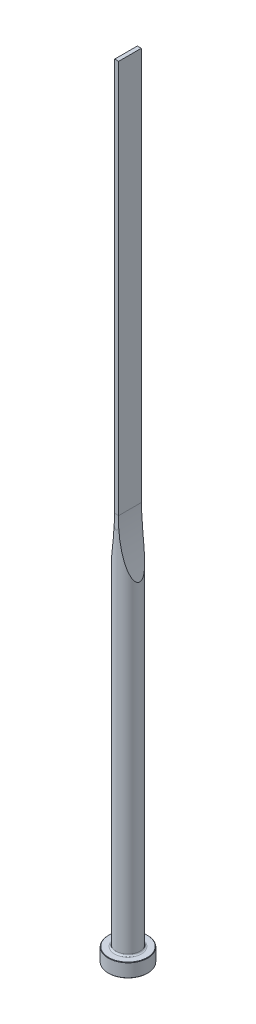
ISO-10303-21;
HEADER;
FILE_DESCRIPTION(('STEP AP214'),'2;1');
FILE_NAME('part.step','',(''),(''),'','','');
FILE_SCHEMA(('AUTOMOTIVE_DESIGN { 1 0 10303 214 1 1 1 1 }'));
ENDSEC;
DATA;
#1=APPLICATION_CONTEXT('core data for automotive mechanical design processes');
#2=APPLICATION_PROTOCOL_DEFINITION('international standard','automotive_design',2000,#1);
#3=PRODUCT_CONTEXT('',#1,'mechanical');
#4=PRODUCT('Part','Part','',(#3));
#5=PRODUCT_RELATED_PRODUCT_CATEGORY('part','',(#4));
#6=PRODUCT_DEFINITION_FORMATION('','',#4);
#7=PRODUCT_DEFINITION_CONTEXT('part definition',#1,'design');
#8=PRODUCT_DEFINITION('design','',#6,#7);
#9=PRODUCT_DEFINITION_SHAPE('','',#8);
#10=(LENGTH_UNIT() NAMED_UNIT(*) SI_UNIT(.MILLI.,.METRE.));
#11=(NAMED_UNIT(*) PLANE_ANGLE_UNIT() SI_UNIT($,.RADIAN.));
#12=(NAMED_UNIT(*) SI_UNIT($,.STERADIAN.) SOLID_ANGLE_UNIT());
#13=UNCERTAINTY_MEASURE_WITH_UNIT(LENGTH_MEASURE(1.E-05),#10,'distance_accuracy_value','');
#14=(GEOMETRIC_REPRESENTATION_CONTEXT(3) GLOBAL_UNCERTAINTY_ASSIGNED_CONTEXT((#13)) GLOBAL_UNIT_ASSIGNED_CONTEXT((#10,
#11,#12)) REPRESENTATION_CONTEXT('',''));
#15=CARTESIAN_POINT('',(0.,0.,0.));
#16=DIRECTION('',(0.,0.,1.));
#17=DIRECTION('',(1.,0.,0.));
#18=AXIS2_PLACEMENT_3D('',#15,#16,#17);
#19=CARTESIAN_POINT('',(0.,0.,0.));
#20=DIRECTION('',(0.,1.,0.));
#21=DIRECTION('',(-1.,0.,0.));
#22=AXIS2_PLACEMENT_3D('',#19,#20,#21);
#23=PLANE('',#22);
#24=CARTESIAN_POINT('',(0.,0.,0.));
#25=DIRECTION('',(0.,1.,0.));
#26=DIRECTION('',(-1.,0.,0.));
#27=AXIS2_PLACEMENT_3D('',#24,#25,#26);
#28=CIRCLE('',#27,9.8);
#29=CARTESIAN_POINT('',(-9.8,0.,0.));
#30=VERTEX_POINT('',#29);
#31=EDGE_CURVE('E133',#30,#30,#28,.T.);
#32=ORIENTED_EDGE('',*,*,#31,.F.);
#33=EDGE_LOOP('',(#32));
#34=FACE_BOUND('',#33,.T.);
#35=ADVANCED_FACE('F32',(#34),#23,.F.);
#36=CARTESIAN_POINT('',(0.,0.,0.));
#37=DIRECTION('',(0.,1.,0.));
#38=DIRECTION('',(-1.,0.,0.));
#39=AXIS2_PLACEMENT_3D('',#36,#37,#38);
#40=CONICAL_SURFACE('',#39,9.8,0.785398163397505);
#41=CARTESIAN_POINT('',(0.,0.199999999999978,0.));
#42=DIRECTION('',(0.,1.,0.));
#43=DIRECTION('',(-1.,0.,0.));
#44=AXIS2_PLACEMENT_3D('',#41,#42,#43);
#45=CIRCLE('',#44,10.);
#46=CARTESIAN_POINT('',(-10.,0.199999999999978,0.));
#47=VERTEX_POINT('',#46);
#48=EDGE_CURVE('E130',#47,#47,#45,.T.);
#49=ORIENTED_EDGE('',*,*,#48,.F.);
#50=EDGE_LOOP('',(#49));
#51=FACE_BOUND('',#50,.T.);
#52=ORIENTED_EDGE('',*,*,#31,.T.);
#53=EDGE_LOOP('',(#52));
#54=FACE_BOUND('',#53,.T.);
#55=ADVANCED_FACE('F171',(#51,#54),#40,.T.);
#56=CARTESIAN_POINT('',(0.,400.,0.));
#57=DIRECTION('',(0.,1.,0.));
#58=DIRECTION('',(-1.,0.,0.));
#59=AXIS2_PLACEMENT_3D('',#56,#57,#58);
#60=CYLINDRICAL_SURFACE('',#59,10.);
#61=CARTESIAN_POINT('',(0.,6.80000000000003,0.));
#62=DIRECTION('',(0.,1.,0.));
#63=DIRECTION('',(-1.,0.,0.));
#64=AXIS2_PLACEMENT_3D('',#61,#62,#63);
#65=CIRCLE('',#64,10.);
#66=CARTESIAN_POINT('',(-10.,6.80000000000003,0.));
#67=VERTEX_POINT('',#66);
#68=EDGE_CURVE('E127',#67,#67,#65,.T.);
#69=ORIENTED_EDGE('',*,*,#68,.F.);
#70=EDGE_LOOP('',(#69));
#71=FACE_BOUND('',#70,.T.);
#72=ORIENTED_EDGE('',*,*,#48,.T.);
#73=EDGE_LOOP('',(#72));
#74=FACE_BOUND('',#73,.T.);
#75=ADVANCED_FACE('F176',(#71,#74),#60,.T.);
#76=CARTESIAN_POINT('',(0.,6.80000000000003,0.));
#77=DIRECTION('',(0.,-1.,0.));
#78=DIRECTION('',(1.,0.,0.));
#79=AXIS2_PLACEMENT_3D('',#76,#77,#78);
#80=CONICAL_SURFACE('',#79,10.,0.785398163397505);
#81=CARTESIAN_POINT('',(0.,7.00000000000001,0.));
#82=DIRECTION('',(0.,1.,0.));
#83=DIRECTION('',(-1.,0.,0.));
#84=AXIS2_PLACEMENT_3D('',#81,#82,#83);
#85=CIRCLE('',#84,9.8);
#86=CARTESIAN_POINT('',(-9.8,7.00000000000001,0.));
#87=VERTEX_POINT('',#86);
#88=EDGE_CURVE('E124',#87,#87,#85,.T.);
#89=ORIENTED_EDGE('',*,*,#88,.F.);
#90=EDGE_LOOP('',(#89));
#91=FACE_BOUND('',#90,.T.);
#92=ORIENTED_EDGE('',*,*,#68,.T.);
#93=EDGE_LOOP('',(#92));
#94=FACE_BOUND('',#93,.T.);
#95=ADVANCED_FACE('F183',(#91,#94),#80,.T.);
#96=CARTESIAN_POINT('',(9.8,7.,0.));
#97=DIRECTION('',(0.,-1.,0.));
#98=DIRECTION('',(1.,0.,0.));
#99=AXIS2_PLACEMENT_3D('',#96,#97,#98);
#100=PLANE('',#99);
#101=CARTESIAN_POINT('',(0.,7.00000000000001,0.));
#102=DIRECTION('',(0.,1.,0.));
#103=DIRECTION('',(-1.,0.,0.));
#104=AXIS2_PLACEMENT_3D('',#101,#102,#103);
#105=CIRCLE('',#104,6.80000000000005);
#106=CARTESIAN_POINT('',(-6.80000000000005,7.00000000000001,0.));
#107=VERTEX_POINT('',#106);
#108=EDGE_CURVE('E121',#107,#107,#105,.T.);
#109=ORIENTED_EDGE('',*,*,#108,.F.);
#110=EDGE_LOOP('',(#109));
#111=FACE_BOUND('',#110,.T.);
#112=ORIENTED_EDGE('',*,*,#88,.T.);
#113=EDGE_LOOP('',(#112));
#114=FACE_BOUND('',#113,.T.);
#115=ADVANCED_FACE('F190',(#111,#114),#100,.F.);
#116=CARTESIAN_POINT('',(0.,7.8,0.));
#117=DIRECTION('',(0.,1.,0.));
#118=DIRECTION('',(-1.,0.,0.));
#119=AXIS2_PLACEMENT_3D('',#116,#117,#118);
#120=TOROIDAL_SURFACE('',#119,6.80000000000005,0.8);
#121=CARTESIAN_POINT('',(0.,7.79999999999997,0.));
#122=DIRECTION('',(0.,1.,0.));
#123=DIRECTION('',(-1.,0.,0.));
#124=AXIS2_PLACEMENT_3D('',#121,#122,#123);
#125=CIRCLE('',#124,6.00000000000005);
#126=CARTESIAN_POINT('',(-6.00000000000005,7.79999999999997,0.));
#127=VERTEX_POINT('',#126);
#128=EDGE_CURVE('E112',#127,#127,#125,.T.);
#129=ORIENTED_EDGE('',*,*,#128,.F.);
#130=EDGE_LOOP('',(#129));
#131=FACE_BOUND('',#130,.T.);
#132=ORIENTED_EDGE('',*,*,#108,.T.);
#133=EDGE_LOOP('',(#132));
#134=FACE_BOUND('',#133,.T.);
#135=ADVANCED_FACE('F168',(#131,#134),#120,.F.);
#136=CARTESIAN_POINT('',(0.,400.,0.));
#137=DIRECTION('',(0.,1.,0.));
#138=DIRECTION('',(-1.,0.,0.));
#139=AXIS2_PLACEMENT_3D('',#136,#137,#138);
#140=CYLINDRICAL_SURFACE('',#139,6.00000000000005);
#141=CARTESIAN_POINT('',(6.00000000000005,170.419601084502,0.));
#142=CARTESIAN_POINT('',(5.99999775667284,170.419607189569,0.125242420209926));
#143=CARTESIAN_POINT('',(5.99603096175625,170.430998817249,0.250508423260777));
#144=CARTESIAN_POINT('',(5.98067932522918,170.475169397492,0.496760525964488));
#145=CARTESIAN_POINT('',(5.96928446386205,170.507977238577,0.617740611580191));
#146=CARTESIAN_POINT('',(5.93705304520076,170.601055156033,0.878870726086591));
#147=CARTESIAN_POINT('',(5.91466618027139,170.665851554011,1.01718646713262));
#148=CARTESIAN_POINT('',(5.86320143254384,170.815556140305,1.28103782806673));
#149=CARTESIAN_POINT('',(5.83411053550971,170.900503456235,1.4065478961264));
#150=CARTESIAN_POINT('',(5.77681570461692,171.068782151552,1.62443423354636));
#151=CARTESIAN_POINT('',(5.74932751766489,171.149855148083,1.71878790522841));
#152=CARTESIAN_POINT('',(5.69208960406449,171.319545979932,1.89977178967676));
#153=CARTESIAN_POINT('',(5.66233827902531,171.408169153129,1.98639644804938));
#154=CARTESIAN_POINT('',(5.6011787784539,171.59136249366,2.15282854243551));
#155=CARTESIAN_POINT('',(5.56976730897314,171.685944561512,2.23262153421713));
#156=CARTESIAN_POINT('',(5.5058240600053,171.879610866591,2.38595788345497));
#157=CARTESIAN_POINT('',(5.47329254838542,171.978694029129,2.45950272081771));
#158=CARTESIAN_POINT('',(5.39715737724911,172.212004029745,2.62320522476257));
#159=CARTESIAN_POINT('',(5.35327162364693,172.347534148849,2.71136896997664));
#160=CARTESIAN_POINT('',(5.26471235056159,172.623340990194,2.8795537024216));
#161=CARTESIAN_POINT('',(5.22003850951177,172.763619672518,2.95957127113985));
#162=CARTESIAN_POINT('',(5.1302437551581,173.048056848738,3.112632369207));
#163=CARTESIAN_POINT('',(5.0851222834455,173.192220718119,3.18566552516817));
#164=CARTESIAN_POINT('',(4.99477653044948,173.483499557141,3.32552790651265));
#165=CARTESIAN_POINT('',(4.94955223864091,173.630614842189,3.39235646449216));
#166=CARTESIAN_POINT('',(4.85901090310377,173.927902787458,3.52082581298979));
#167=CARTESIAN_POINT('',(4.81369435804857,174.078086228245,3.58244190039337));
#168=CARTESIAN_POINT('',(4.72333124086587,174.380450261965,3.7007677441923));
#169=CARTESIAN_POINT('',(4.67828467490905,174.532630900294,3.75747738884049));
#170=CARTESIAN_POINT('',(4.58862652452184,174.838523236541,3.86645577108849));
#171=CARTESIAN_POINT('',(4.54401457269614,174.992233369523,3.91872861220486));
#172=CARTESIAN_POINT('',(4.45527805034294,175.301074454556,4.01932733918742));
#173=CARTESIAN_POINT('',(4.41115348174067,175.456205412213,4.0676532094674));
#174=CARTESIAN_POINT('',(4.29641025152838,175.863804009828,4.18945912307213));
#175=CARTESIAN_POINT('',(4.22624526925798,176.117262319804,4.26005871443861));
#176=CARTESIAN_POINT('',(4.08762442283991,176.626752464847,4.39323954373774));
#177=CARTESIAN_POINT('',(4.01916875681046,176.882784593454,4.45581985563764));
#178=CARTESIAN_POINT('',(3.88411563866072,177.397049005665,4.57402486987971));
#179=CARTESIAN_POINT('',(3.81751897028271,177.655282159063,4.62964667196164));
#180=CARTESIAN_POINT('',(3.68633760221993,178.173506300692,4.73476129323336));
#181=CARTESIAN_POINT('',(3.62175301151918,178.433497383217,4.78425378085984));
#182=CARTESIAN_POINT('',(3.43093594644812,179.216641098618,4.9248112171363));
#183=CARTESIAN_POINT('',(3.30788392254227,179.742036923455,5.0077489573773));
#184=CARTESIAN_POINT('',(3.07078215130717,180.79726021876,5.15653257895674));
#185=CARTESIAN_POINT('',(2.95673337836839,181.327088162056,5.22237661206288));
#186=CARTESIAN_POINT('',(2.79250802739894,182.125090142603,5.31090921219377));
#187=CARTESIAN_POINT('',(2.73884045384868,182.391992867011,5.33874481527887));
#188=CARTESIAN_POINT('',(2.63387849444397,182.926548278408,5.39130136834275));
#189=CARTESIAN_POINT('',(2.58258392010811,183.194200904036,5.41602256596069));
#190=CARTESIAN_POINT('',(2.43228253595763,183.998226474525,5.4860046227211));
#191=CARTESIAN_POINT('',(2.33686353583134,184.535640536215,5.52708106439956));
#192=CARTESIAN_POINT('',(2.15582892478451,185.612127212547,5.60016992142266));
#193=CARTESIAN_POINT('',(2.07020309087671,186.15119748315,5.63219184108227));
#194=CARTESIAN_POINT('',(1.90872365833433,187.231186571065,5.68894511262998));
#195=CARTESIAN_POINT('',(1.83287021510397,187.772105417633,5.71367634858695));
#196=CARTESIAN_POINT('',(1.6912078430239,188.853864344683,5.75719432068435));
#197=CARTESIAN_POINT('',(1.62536994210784,189.3946999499,5.77599837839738));
#198=CARTESIAN_POINT('',(1.50351191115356,190.477630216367,5.80890983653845));
#199=CARTESIAN_POINT('',(1.44749203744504,191.019724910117,5.82301711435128));
#200=CARTESIAN_POINT('',(1.34529714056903,192.104979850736,5.84747253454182));
#201=CARTESIAN_POINT('',(1.29912312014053,192.648140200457,5.85782029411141));
#202=CARTESIAN_POINT('',(1.21664859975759,193.73525968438,5.8755037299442));
#203=CARTESIAN_POINT('',(1.1803481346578,194.279218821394,5.88283939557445));
#204=CARTESIAN_POINT('',(1.11760674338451,195.368246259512,5.89508076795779));
#205=CARTESIAN_POINT('',(1.09117513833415,195.913315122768,5.8999841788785));
#206=CARTESIAN_POINT('',(1.04823003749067,197.003858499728,5.90776520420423));
#207=CARTESIAN_POINT('',(1.03171656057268,197.549333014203,5.91064281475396));
#208=CARTESIAN_POINT('',(1.0086147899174,198.640462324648,5.91462876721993));
#209=CARTESIAN_POINT('',(1.00202583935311,199.186117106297,5.9157372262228));
#210=CARTESIAN_POINT('',(0.998773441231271,200.277468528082,5.9162872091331));
#211=CARTESIAN_POINT('',(1.0021102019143,200.823165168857,5.91572869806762));
#212=CARTESIAN_POINT('',(1.01869111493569,201.913263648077,5.91289599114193));
#213=CARTESIAN_POINT('',(1.03191456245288,202.45766581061,5.91062538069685));
#214=CARTESIAN_POINT('',(1.0682394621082,203.546117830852,5.90416844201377));
#215=CARTESIAN_POINT('',(1.09134070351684,204.090167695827,5.89998215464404));
#216=CARTESIAN_POINT('',(1.14741473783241,205.177785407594,5.88933394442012));
#217=CARTESIAN_POINT('',(1.18038841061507,205.721353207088,5.88287181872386));
#218=CARTESIAN_POINT('',(1.25619292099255,206.807759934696,5.86715249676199));
#219=CARTESIAN_POINT('',(1.29902372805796,207.350598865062,5.85789530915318));
#220=CARTESIAN_POINT('',(1.3944799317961,208.434849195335,5.83590809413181));
#221=CARTESIAN_POINT('',(1.4470964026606,208.976261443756,5.82318122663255));
#222=CARTESIAN_POINT('',(1.56212230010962,210.057923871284,5.7933846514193));
#223=CARTESIAN_POINT('',(1.62453165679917,210.598174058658,5.77631497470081));
#224=CARTESIAN_POINT('',(1.7590950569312,211.677175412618,5.73676759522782));
#225=CARTESIAN_POINT('',(1.83124753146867,212.215926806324,5.71429076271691));
#226=CARTESIAN_POINT('',(1.98524953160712,213.291705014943,5.66263106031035));
#227=CARTESIAN_POINT('',(2.06709862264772,213.828731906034,5.63344849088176));
#228=CARTESIAN_POINT('',(2.2130038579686,214.731161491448,5.57733188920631));
#229=CARTESIAN_POINT('',(2.27449844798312,215.09711766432,5.55260662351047));
#230=CARTESIAN_POINT('',(2.40194906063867,215.827916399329,5.49867559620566));
#231=CARTESIAN_POINT('',(2.46790497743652,216.192758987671,5.4694699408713));
#232=CARTESIAN_POINT('',(2.60424949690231,216.921248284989,5.40588058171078));
#233=CARTESIAN_POINT('',(2.67463906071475,217.284894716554,5.37149575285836));
#234=CARTESIAN_POINT('',(2.8197784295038,218.010704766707,5.29674573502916));
#235=CARTESIAN_POINT('',(2.89452823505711,218.372868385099,5.25638054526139));
#236=CARTESIAN_POINT('',(3.04820460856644,219.094966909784,5.16877779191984));
#237=CARTESIAN_POINT('',(3.12712545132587,219.454904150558,5.12154950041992));
#238=CARTESIAN_POINT('',(3.28912302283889,220.172689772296,5.01904986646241));
#239=CARTESIAN_POINT('',(3.3721996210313,220.530538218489,4.96377877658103));
#240=CARTESIAN_POINT('',(3.54231681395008,221.243538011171,4.84384389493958));
#241=CARTESIAN_POINT('',(3.62935549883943,221.598690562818,4.77918459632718));
#242=CARTESIAN_POINT('',(3.80720655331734,222.305820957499,4.63875280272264));
#243=CARTESIAN_POINT('',(3.89801851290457,222.657799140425,4.56298151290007));
#244=CARTESIAN_POINT('',(4.08342709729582,223.358966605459,4.39785138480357));
#245=CARTESIAN_POINT('',(4.17803592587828,223.70814169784,4.30844562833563));
#246=CARTESIAN_POINT('',(4.37029964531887,224.401317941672,4.11330947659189));
#247=CARTESIAN_POINT('',(4.46795582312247,224.745316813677,4.00757210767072));
#248=CARTESIAN_POINT('',(4.61614246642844,225.255904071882,3.83366636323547));
#249=CARTESIAN_POINT('',(4.66586049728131,225.425325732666,3.77309553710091));
#250=CARTESIAN_POINT('',(4.76568777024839,225.761874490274,3.6461966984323));
#251=CARTESIAN_POINT('',(4.81579697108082,225.929001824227,3.57986928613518));
#252=CARTESIAN_POINT('',(4.91617313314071,226.260325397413,3.44072598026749));
#253=CARTESIAN_POINT('',(4.96643993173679,226.424523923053,3.36791544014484));
#254=CARTESIAN_POINT('',(5.06689358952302,226.749394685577,3.21480576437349));
#255=CARTESIAN_POINT('',(5.1170804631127,226.910067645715,3.13450818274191));
#256=CARTESIAN_POINT('',(5.21752644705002,227.228576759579,2.96433606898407));
#257=CARTESIAN_POINT('',(5.2677809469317,227.386366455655,2.87437116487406));
#258=CARTESIAN_POINT('',(5.36725447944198,227.695834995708,2.68404781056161));
#259=CARTESIAN_POINT('',(5.41647403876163,227.847516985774,2.58369480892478));
#260=CARTESIAN_POINT('',(5.51277525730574,228.141752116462,2.37125323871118));
#261=CARTESIAN_POINT('',(5.55986802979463,228.284354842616,2.25923918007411));
#262=CARTESIAN_POINT('',(5.65090527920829,228.557883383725,2.02077972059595));
#263=CARTESIAN_POINT('',(5.6948549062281,228.688828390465,1.89435885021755));
#264=CARTESIAN_POINT('',(5.76730290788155,228.903231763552,1.65813330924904));
#265=CARTESIAN_POINT('',(5.79691960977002,228.990384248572,1.55205897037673));
#266=CARTESIAN_POINT('',(5.85202977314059,229.151851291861,1.32925640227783));
#267=CARTESIAN_POINT('',(5.87752021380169,229.226156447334,1.21252046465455));
#268=CARTESIAN_POINT('',(5.92291805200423,229.358049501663,0.966850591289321));
#269=CARTESIAN_POINT('',(5.94275517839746,229.415427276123,0.837787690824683));
#270=CARTESIAN_POINT('',(5.97430478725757,229.506499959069,0.570644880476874));
#271=CARTESIAN_POINT('',(5.9860351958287,229.540247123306,0.432585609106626));
#272=CARTESIAN_POINT('',(5.99919214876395,229.578084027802,0.162766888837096));
#273=CARTESIAN_POINT('',(6.00134328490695,229.584259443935,0.0313422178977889));
#274=CARTESIAN_POINT('',(5.99700901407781,229.571803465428,-0.230194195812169));
#275=CARTESIAN_POINT('',(5.99052146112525,229.553165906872,-0.360305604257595));
#276=CARTESIAN_POINT('',(5.97128614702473,229.497771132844,-0.596490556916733));
#277=CARTESIAN_POINT('',(5.95955071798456,229.463941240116,-0.703365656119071));
#278=CARTESIAN_POINT('',(5.93136732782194,229.382471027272,-0.910966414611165));
#279=CARTESIAN_POINT('',(5.91491844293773,229.334827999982,-1.01169086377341));
#280=CARTESIAN_POINT('',(5.86553987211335,229.191312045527,-1.27427049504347));
#281=CARTESIAN_POINT('',(5.82912016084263,229.084985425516,-1.42972634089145));
#282=CARTESIAN_POINT('',(5.74961855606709,228.851132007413,-1.72190983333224));
#283=CARTESIAN_POINT('',(5.70651443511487,228.723534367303,-1.85857201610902));
#284=CARTESIAN_POINT('',(5.6189782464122,228.462238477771,-2.10794871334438));
#285=CARTESIAN_POINT('',(5.57477388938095,228.32934207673,-2.22159958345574));
#286=CARTESIAN_POINT('',(5.48416424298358,228.054639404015,-2.43671420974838));
#287=CARTESIAN_POINT('',(5.43775690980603,227.912824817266,-2.53816632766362));
#288=CARTESIAN_POINT('',(5.3435832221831,227.622483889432,-2.7308663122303));
#289=CARTESIAN_POINT('',(5.29581433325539,227.473944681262,-2.82209334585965));
#290=CARTESIAN_POINT('',(5.19962805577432,227.17206815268,-2.99561144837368));
#291=CARTESIAN_POINT('',(5.15121092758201,227.018732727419,-3.07790599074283));
#292=CARTESIAN_POINT('',(5.02856678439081,226.626569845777,-3.27618912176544));
#293=CARTESIAN_POINT('',(4.95417194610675,226.38523499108,-3.38710592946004));
#294=CARTESIAN_POINT('',(4.80575902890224,225.89629733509,-3.59456631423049));
#295=CARTESIAN_POINT('',(4.73174116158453,225.648691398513,-3.69110252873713));
#296=CARTESIAN_POINT('',(4.58458577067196,225.148444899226,-3.8723657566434));
#297=CARTESIAN_POINT('',(4.5114500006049,224.8957963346,-3.9570719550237));
#298=CARTESIAN_POINT('',(4.36658882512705,224.386924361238,-4.11636762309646));
#299=CARTESIAN_POINT('',(4.29486358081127,224.130700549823,-4.19095594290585));
#300=CARTESIAN_POINT('',(4.15278444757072,223.614258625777,-4.33179261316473));
#301=CARTESIAN_POINT('',(4.08243835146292,223.354027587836,-4.39800116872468));
#302=CARTESIAN_POINT('',(3.94365659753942,222.831255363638,-4.52286201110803));
#303=CARTESIAN_POINT('',(3.87522100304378,222.568714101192,-4.58151404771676));
#304=CARTESIAN_POINT('',(3.74048483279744,222.042023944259,-4.6921596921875));
#305=CARTESIAN_POINT('',(3.67418193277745,221.777877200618,-4.74416074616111));
#306=CARTESIAN_POINT('',(3.5437392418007,221.247986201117,-4.84237219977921));
#307=CARTESIAN_POINT('',(3.47959944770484,220.982241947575,-4.88858260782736));
#308=CARTESIAN_POINT('',(3.31010347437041,220.26563560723,-5.00599993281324));
#309=CARTESIAN_POINT('',(3.20682871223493,219.813500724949,-5.07246697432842));
#310=CARTESIAN_POINT('',(3.00696752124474,218.906139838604,-5.19343466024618));
#311=CARTESIAN_POINT('',(2.91038185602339,218.450913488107,-5.24793393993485));
#312=CARTESIAN_POINT('',(2.72405514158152,217.537809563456,-5.34702333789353));
#313=CARTESIAN_POINT('',(2.63431680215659,217.079931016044,-5.3916095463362));
#314=CARTESIAN_POINT('',(2.46185131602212,216.162124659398,-5.47250894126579));
#315=CARTESIAN_POINT('',(2.37912435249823,215.702196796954,-5.50882191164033));
#316=CARTESIAN_POINT('',(2.22060946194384,214.779692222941,-5.57460936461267));
#317=CARTESIAN_POINT('',(2.14483606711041,214.31711201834,-5.60406971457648));
#318=CARTESIAN_POINT('',(2.00048108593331,213.390500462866,-5.65720666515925));
#319=CARTESIAN_POINT('',(1.93189955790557,212.926469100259,-5.68088321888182));
#320=CARTESIAN_POINT('',(1.80198761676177,211.997274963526,-5.72341801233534));
#321=CARTESIAN_POINT('',(1.74065566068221,211.532112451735,-5.74227727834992));
#322=CARTESIAN_POINT('',(1.62525795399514,210.600740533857,-5.77599627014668));
#323=CARTESIAN_POINT('',(1.57119233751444,210.134531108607,-5.79085592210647));
#324=CARTESIAN_POINT('',(1.41952321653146,208.730777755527,-5.83061132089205));
#325=CARTESIAN_POINT('',(1.33297412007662,207.791873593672,-5.85052312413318));
#326=CARTESIAN_POINT('',(1.18941363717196,205.911655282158,-5.88138038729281));
#327=CARTESIAN_POINT('',(1.1324035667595,204.970341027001,-5.89232544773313));
#328=CARTESIAN_POINT('',(1.0480514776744,203.087652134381,-5.90791250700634));
#329=CARTESIAN_POINT('',(1.02066798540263,202.146279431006,-5.91256331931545));
#330=CARTESIAN_POINT('',(0.995458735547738,200.263151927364,-5.91685902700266));
#331=CARTESIAN_POINT('',(0.997632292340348,199.321397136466,-5.91650403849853));
#332=CARTESIAN_POINT('',(1.03154557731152,197.437741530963,-5.91068654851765));
#333=CARTESIAN_POINT('',(1.06330697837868,196.495841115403,-5.90522030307));
#334=CARTESIAN_POINT('',(1.15639203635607,194.613524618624,-5.88769860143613));
#335=CARTESIAN_POINT('',(1.21771697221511,193.673108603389,-5.87564286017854));
#336=CARTESIAN_POINT('',(1.37003026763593,191.792670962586,-5.84201750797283));
#337=CARTESIAN_POINT('',(1.4610854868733,190.852655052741,-5.82042641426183));
#338=CARTESIAN_POINT('',(1.61976731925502,189.445530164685,-5.77748168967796));
#339=CARTESIAN_POINT('',(1.67634191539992,188.976989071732,-5.76140789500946));
#340=CARTESIAN_POINT('',(1.79683049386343,188.041021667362,-5.72497854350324));
#341=CARTESIAN_POINT('',(1.86074431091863,187.573595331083,-5.70462308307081));
#342=CARTESIAN_POINT('',(1.99506969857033,186.645616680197,-5.65903386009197));
#343=CARTESIAN_POINT('',(2.06539470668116,186.185048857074,-5.63386115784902));
#344=CARTESIAN_POINT('',(2.21312421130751,185.265429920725,-5.57748469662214));
#345=CARTESIAN_POINT('',(2.2905284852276,184.80637876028,-5.54628112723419));
#346=CARTESIAN_POINT('',(2.45239786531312,183.889790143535,-5.47663362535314));
#347=CARTESIAN_POINT('',(2.53686705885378,183.432253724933,-5.43818548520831));
#348=CARTESIAN_POINT('',(2.71272931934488,182.519327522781,-5.35263180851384));
#349=CARTESIAN_POINT('',(2.80412221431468,182.063937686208,-5.30552648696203));
#350=CARTESIAN_POINT('',(2.99332338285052,181.157538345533,-5.20112020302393));
#351=CARTESIAN_POINT('',(3.09110511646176,180.706518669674,-5.14385991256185));
#352=CARTESIAN_POINT('',(3.29321309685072,179.807631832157,-5.01687239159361));
#353=CARTESIAN_POINT('',(3.39754007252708,179.35976502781,-4.9471437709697));
#354=CARTESIAN_POINT('',(3.6122986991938,178.468639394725,-4.7925769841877));
#355=CARTESIAN_POINT('',(3.72272344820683,178.025376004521,-4.70775566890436));
#356=CARTESIAN_POINT('',(3.94928670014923,177.144366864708,-4.51939233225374));
#357=CARTESIAN_POINT('',(4.06542330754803,176.706619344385,-4.41585649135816));
#358=CARTESIAN_POINT('',(4.20946974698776,176.179563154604,-4.27569986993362));
#359=CARTESIAN_POINT('',(4.23504568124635,176.086573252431,-4.2503781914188));
#360=CARTESIAN_POINT('',(4.28641223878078,175.900975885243,-4.19857173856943));
#361=CARTESIAN_POINT('',(4.31220286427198,175.808368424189,-4.17208695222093));
#362=CARTESIAN_POINT('',(4.38988595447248,175.53114258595,-4.09078536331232));
#363=CARTESIAN_POINT('',(4.44208320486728,175.347144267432,-4.03412754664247));
#364=CARTESIAN_POINT('',(4.54731866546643,174.980600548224,-3.91512739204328));
#365=CARTESIAN_POINT('',(4.60035886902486,174.798060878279,-3.85276910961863));
#366=CARTESIAN_POINT('',(4.70696776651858,174.435409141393,-3.72177186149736));
#367=CARTESIAN_POINT('',(4.76053642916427,174.255296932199,-3.6531332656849));
#368=CARTESIAN_POINT('',(4.87563201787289,173.872646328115,-3.49839982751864));
#369=CARTESIAN_POINT('',(4.93720737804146,173.670561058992,-3.4112106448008));
#370=CARTESIAN_POINT('',(5.06030283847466,173.271512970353,-3.22579089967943));
#371=CARTESIAN_POINT('',(5.12182294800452,173.07454901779,-3.12756280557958));
#372=CARTESIAN_POINT('',(5.24391728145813,172.688186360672,-2.91821502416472));
#373=CARTESIAN_POINT('',(5.30449407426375,172.498763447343,-2.80714197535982));
#374=CARTESIAN_POINT('',(5.42380766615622,172.12971521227,-2.56905944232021));
#375=CARTESIAN_POINT('',(5.48254648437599,171.950078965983,-2.44206827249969));
#376=CARTESIAN_POINT('',(5.58357518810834,171.644150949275,-2.19927757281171));
#377=CARTESIAN_POINT('',(5.62658135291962,171.514981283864,-2.08743966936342));
#378=CARTESIAN_POINT('',(5.7091977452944,171.26855514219,-1.84957852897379));
#379=CARTESIAN_POINT('',(5.748802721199,171.151317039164,-1.7235340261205));
#380=CARTESIAN_POINT('',(5.82301089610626,170.932939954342,-1.45343537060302));
#381=CARTESIAN_POINT('',(5.85753618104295,170.832049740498,-1.30915348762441));
#382=CARTESIAN_POINT('',(5.9175454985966,170.657462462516,-1.00330272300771));
#383=CARTESIAN_POINT('',(5.94306640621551,170.583654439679,-0.841807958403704));
#384=CARTESIAN_POINT('',(5.97431451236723,170.493488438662,-0.565200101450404));
#385=CARTESIAN_POINT('',(5.98385628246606,170.466025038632,-0.45414792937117));
#386=CARTESIAN_POINT('',(5.99669757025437,170.429085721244,-0.228735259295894));
#387=CARTESIAN_POINT('',(6.00000204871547,170.419595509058,-0.114377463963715));
#388=CARTESIAN_POINT('',(6.00000000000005,170.419601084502,0.));
#389=B_SPLINE_CURVE_WITH_KNOTS('',3,(#141,#142,#143,#144,#145,#146,#147,#148,#149,#150,#151,
#152,#153,#154,#155,#156,#157,#158,#159,#160,#161,#162,#163,#164,#165,#166,#167,#168,#169,#170,
#171,#172,#173,#174,#175,#176,#177,#178,#179,#180,#181,#182,#183,#184,#185,#186,#187,#188,#189,
#190,#191,#192,#193,#194,#195,#196,#197,#198,#199,#200,#201,#202,#203,#204,#205,#206,#207,#208,
#209,#210,#211,#212,#213,#214,#215,#216,#217,#218,#219,#220,#221,#222,#223,#224,#225,#226,#227,
#228,#229,#230,#231,#232,#233,#234,#235,#236,#237,#238,#239,#240,#241,#242,#243,#244,#245,#246,
#247,#248,#249,#250,#251,#252,#253,#254,#255,#256,#257,#258,#259,#260,#261,#262,#263,#264,#265,
#266,#267,#268,#269,#270,#271,#272,#273,#274,#275,#276,#277,#278,#279,#280,#281,#282,#283,#284,
#285,#286,#287,#288,#289,#290,#291,#292,#293,#294,#295,#296,#297,#298,#299,#300,#301,#302,#303,
#304,#305,#306,#307,#308,#309,#310,#311,#312,#313,#314,#315,#316,#317,#318,#319,#320,#321,#322,
#323,#324,#325,#326,#327,#328,#329,#330,#331,#332,#333,#334,#335,#336,#337,#338,#339,#340,#341,
#342,#343,#344,#345,#346,#347,#348,#349,#350,#351,#352,#353,#354,#355,#356,#357,#358,#359,#360,
#361,#362,#363,#364,#365,#366,#367,#368,#369,#370,#371,#372,#373,#374,#375,#376,#377,#378,#379,
#380,#381,#382,#383,#384,#385,#386,#387,#388),.UNSPECIFIED.,.T.,.F.,(4,2,2,2,2,2,2,2,2,2,2,2,2,
2,2,2,2,2,2,2,2,2,2,2,2,2,2,2,2,2,2,2,2,2,2,2,2,2,2,2,2,2,2,2,2,2,2,2,2,2,2,2,2,2,2,2,2,2,2,2,2,
2,2,2,2,2,2,2,2,2,2,2,2,2,2,2,2,2,2,2,2,2,2,2,2,2,2,2,2,2,2,2,2,2,2,2,2,2,2,2,2,2,2,2,2,2,2,2,2,
2,2,2,2,2,2,2,2,2,2,2,2,2,2,4),(0.,0.375228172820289,0.750963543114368,1.21148286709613,
1.67290382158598,2.05457288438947,2.43651405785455,2.81924379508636,3.20188262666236,
3.70413932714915,4.20660593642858,4.70980759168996,5.21306331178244,5.71858410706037,
6.22411641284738,6.72917594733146,7.23423747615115,8.05097248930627,8.86780173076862,
9.6849702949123,10.5021830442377,12.1395484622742,13.7770908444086,14.5980582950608,
15.418960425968,17.060846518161,18.7010027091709,20.3411849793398,21.9765285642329,
23.6119148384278,25.2474675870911,26.8830261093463,28.5201255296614,30.1572280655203,
31.7942222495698,33.4312507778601,35.0648605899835,36.6984355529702,38.332156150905,
39.9658716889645,41.5981043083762,43.2303252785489,44.8622837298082,46.4941690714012,
47.609849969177,48.7255044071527,49.8414015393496,50.9572988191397,52.0717022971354,
53.18607078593,54.2999076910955,55.4136238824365,56.5312628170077,57.649380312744,
58.2092978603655,58.7691570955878,59.3285582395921,59.8878435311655,60.45290698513,
61.0176755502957,61.5790343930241,62.1394513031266,62.559967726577,62.9807906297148,
63.4066365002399,63.8315376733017,64.223684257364,64.6159282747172,64.9528337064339,
65.289805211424,65.8619626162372,66.4360650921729,66.9763567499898,67.5171598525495,
68.059045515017,68.6007196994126,69.4275798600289,70.2548619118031,71.0835817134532,
71.9123956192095,72.7450085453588,73.5776490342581,74.4093490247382,75.2410478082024,
76.6463331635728,78.0517786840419,79.4577775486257,80.8638131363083,82.2727232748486,
83.6816448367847,85.0902659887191,86.498913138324,89.3276158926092,92.1564446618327,
94.9813082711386,97.8061063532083,100.632975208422,103.459966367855,106.293359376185,
107.70995050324,109.126509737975,110.526178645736,111.925803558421,113.326243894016,
114.726649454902,116.121567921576,117.516642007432,118.91016816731,120.303234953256,
120.602364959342,120.901498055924,121.499839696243,122.099909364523,122.699943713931,
123.385305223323,124.07051378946,124.753308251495,125.435324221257,125.963134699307,
126.491746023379,127.027768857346,127.561570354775,127.904519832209,128.247196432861),.UNSPECIFIED.);
#390=CARTESIAN_POINT('',(1.14059027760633,194.971433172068,-5.89059027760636));
#391=VERTEX_POINT('',#390);
#392=CARTESIAN_POINT('',(1.14059027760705,194.971433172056,5.89059027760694));
#393=VERTEX_POINT('',#392);
#394=EDGE_CURVE('E138',#391,#393,#389,.T.);
#395=ORIENTED_EDGE('',*,*,#394,.T.);
#396=CARTESIAN_POINT('',(-1.71391365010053,200.,5.74999999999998));
#397=CARTESIAN_POINT('',(-1.71391988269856,200.360232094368,5.75000022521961));
#398=CARTESIAN_POINT('',(-1.70670690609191,200.7204849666,5.75216429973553));
#399=CARTESIAN_POINT('',(-1.67730271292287,201.440311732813,5.76080572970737));
#400=CARTESIAN_POINT('',(-1.65511191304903,201.799885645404,5.7672829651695));
#401=CARTESIAN_POINT('',(-1.59385315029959,202.518394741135,5.78452322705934));
#402=CARTESIAN_POINT('',(-1.55474710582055,202.87732663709,5.79529591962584));
#403=CARTESIAN_POINT('',(-1.48033674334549,203.41327242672,5.81457014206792));
#404=CARTESIAN_POINT('',(-1.45292096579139,203.591447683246,5.82151097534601));
#405=CARTESIAN_POINT('',(-1.39191289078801,203.946689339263,5.83640137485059));
#406=CARTESIAN_POINT('',(-1.3583215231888,204.123755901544,5.84435078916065));
#407=CARTESIAN_POINT('',(-1.29127878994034,204.440079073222,5.85948118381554));
#408=CARTESIAN_POINT('',(-1.25921382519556,204.579636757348,5.86648499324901));
#409=CARTESIAN_POINT('',(-1.18926063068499,204.857383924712,5.88106678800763));
#410=CARTESIAN_POINT('',(-1.15136840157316,204.995572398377,5.88864516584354));
#411=CARTESIAN_POINT('',(-1.06831244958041,205.269233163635,5.90427715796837));
#412=CARTESIAN_POINT('',(-1.02317340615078,205.404712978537,5.91232910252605));
#413=CARTESIAN_POINT('',(-0.923002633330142,205.671884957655,5.92880254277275));
#414=CARTESIAN_POINT('',(-0.867986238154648,205.803582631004,5.93722345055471));
#415=CARTESIAN_POINT('',(-0.766634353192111,206.011378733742,5.95094792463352));
#416=CARTESIAN_POINT('',(-0.724867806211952,206.089690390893,5.95622768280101));
#417=CARTESIAN_POINT('',(-0.633381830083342,206.241543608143,5.96665610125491));
#418=CARTESIAN_POINT('',(-0.583681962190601,206.315096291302,5.97180504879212));
#419=CARTESIAN_POINT('',(-0.500547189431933,206.418351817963,5.97914745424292));
#420=CARTESIAN_POINT('',(-0.471478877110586,206.451525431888,5.98152654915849));
#421=CARTESIAN_POINT('',(-0.409756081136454,206.514467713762,5.98607241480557));
#422=CARTESIAN_POINT('',(-0.377102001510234,206.54423676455,5.98823920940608));
#423=CARTESIAN_POINT('',(-0.314953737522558,206.592746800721,5.99179060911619));
#424=CARTESIAN_POINT('',(-0.286256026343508,206.612487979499,5.99324366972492));
#425=CARTESIAN_POINT('',(-0.226115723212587,206.647269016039,5.99581280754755));
#426=CARTESIAN_POINT('',(-0.194679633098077,206.662319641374,5.99692965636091));
#427=CARTESIAN_POINT('',(-0.137318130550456,206.683161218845,5.99847946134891));
#428=CARTESIAN_POINT('',(-0.111895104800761,206.690310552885,5.99901243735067));
#429=CARTESIAN_POINT('',(-0.0602062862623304,206.70024307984,5.99975337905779));
#430=CARTESIAN_POINT('',(-0.0339414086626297,206.703030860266,5.99996168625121));
#431=CARTESIAN_POINT('',(0.0187279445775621,206.703927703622,6.00002867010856));
#432=CARTESIAN_POINT('',(0.0451325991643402,206.702026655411,5.99988659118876));
#433=CARTESIAN_POINT('',(0.0972283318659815,206.693750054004,5.99926893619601));
#434=CARTESIAN_POINT('',(0.122918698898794,206.687370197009,5.99879303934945));
#435=CARTESIAN_POINT('',(0.180222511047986,206.668376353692,5.99737959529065));
#436=CARTESIAN_POINT('',(0.211408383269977,206.654495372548,5.99634851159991));
#437=CARTESIAN_POINT('',(0.27117039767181,206.62198630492,5.99394413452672));
#438=CARTESIAN_POINT('',(0.299740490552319,206.603347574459,5.99257007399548));
#439=CARTESIAN_POINT('',(0.373829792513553,206.548222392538,5.98852729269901));
#440=CARTESIAN_POINT('',(0.416890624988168,206.508492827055,5.98563453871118));
#441=CARTESIAN_POINT('',(0.497042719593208,206.423494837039,5.97951175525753));
#442=CARTESIAN_POINT('',(0.534115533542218,206.378210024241,5.97628073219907));
#443=CARTESIAN_POINT('',(0.61988723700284,206.262394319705,5.96811343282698));
#444=CARTESIAN_POINT('',(0.665945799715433,206.189938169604,5.96308457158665));
#445=CARTESIAN_POINT('',(0.751194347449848,206.041041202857,5.95294302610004));
#446=CARTESIAN_POINT('',(0.790368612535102,205.964591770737,5.94783017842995));
#447=CARTESIAN_POINT('',(0.863732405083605,205.808846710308,5.93762100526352));
#448=CARTESIAN_POINT('',(0.897893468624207,205.729537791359,5.93252492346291));
#449=CARTESIAN_POINT('',(0.962086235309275,205.56938465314,5.92245190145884));
#450=CARTESIAN_POINT('',(0.992122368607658,205.48854218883,5.91747483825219));
#451=CARTESIAN_POINT('',(1.0725604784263,205.25792403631,5.90359472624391));
#452=CARTESIAN_POINT('',(1.11909878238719,205.106793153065,5.89487290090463));
#453=CARTESIAN_POINT('',(1.20416724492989,204.802231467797,5.8780806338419));
#454=CARTESIAN_POINT('',(1.24269263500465,204.648799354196,5.87001058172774));
#455=CARTESIAN_POINT('',(1.31348491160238,204.340145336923,5.8545771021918));
#456=CARTESIAN_POINT('',(1.34573891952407,204.184920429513,5.84721514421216));
#457=CARTESIAN_POINT('',(1.40500539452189,203.873431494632,5.83325598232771));
#458=CARTESIAN_POINT('',(1.43201709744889,203.717167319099,5.82665888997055));
#459=CARTESIAN_POINT('',(1.50637758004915,203.247239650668,5.80805390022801));
#460=CARTESIAN_POINT('',(1.5470465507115,202.932464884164,5.79723348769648));
#461=CARTESIAN_POINT('',(1.61419698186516,202.301766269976,5.77888587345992));
#462=CARTESIAN_POINT('',(1.64069532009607,201.985844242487,5.77135475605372));
#463=CARTESIAN_POINT('',(1.68834801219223,201.246171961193,5.75763237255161));
#464=CARTESIAN_POINT('',(1.70466595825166,200.822080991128,5.75275515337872));
#465=CARTESIAN_POINT('',(1.71726032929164,199.973290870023,5.74900212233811));
#466=CARTESIAN_POINT('',(1.71352141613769,199.548591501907,5.75013090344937));
#467=CARTESIAN_POINT('',(1.68556859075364,198.699396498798,5.75839581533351));
#468=CARTESIAN_POINT('',(1.66133235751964,198.274901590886,5.76553849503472));
#469=CARTESIAN_POINT('',(1.60743023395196,197.639971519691,5.78069922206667));
#470=CARTESIAN_POINT('',(1.58655066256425,197.428718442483,5.78649055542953));
#471=CARTESIAN_POINT('',(1.5381997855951,197.007023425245,5.79953269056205));
#472=CARTESIAN_POINT('',(1.51072919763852,196.79658139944,5.80678333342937));
#473=CARTESIAN_POINT('',(1.44802861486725,196.376216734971,5.82273739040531));
#474=CARTESIAN_POINT('',(1.41277459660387,196.166297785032,5.83144528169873));
#475=CARTESIAN_POINT('',(1.33275702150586,195.748030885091,5.85025220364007));
#476=CARTESIAN_POINT('',(1.28798068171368,195.539685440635,5.8603530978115));
#477=CARTESIAN_POINT('',(1.18625496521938,195.126695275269,5.88179991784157));
#478=CARTESIAN_POINT('',(1.12934956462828,194.922040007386,5.89314127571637));
#479=CARTESIAN_POINT('',(1.03065050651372,194.619678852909,5.91090853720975));
#480=CARTESIAN_POINT('',(0.995571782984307,194.519766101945,5.9169499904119));
#481=CARTESIAN_POINT('',(0.919681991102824,194.322175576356,5.92922251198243));
#482=CARTESIAN_POINT('',(0.878874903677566,194.224496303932,5.93545344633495));
#483=CARTESIAN_POINT('',(0.7893004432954,194.032115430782,5.94803051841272));
#484=CARTESIAN_POINT('',(0.7404856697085,193.937435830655,5.95437712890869));
#485=CARTESIAN_POINT('',(0.631843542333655,193.754833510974,5.96689426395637));
#486=CARTESIAN_POINT('',(0.572086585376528,193.666872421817,5.97306563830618));
#487=CARTESIAN_POINT('',(0.479606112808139,193.557948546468,5.9808471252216));
#488=CARTESIAN_POINT('',(0.454538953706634,193.530582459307,5.9828159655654));
#489=CARTESIAN_POINT('',(0.401755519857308,193.478381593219,5.98659336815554));
#490=CARTESIAN_POINT('',(0.374034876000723,193.45355113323,5.98840165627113));
#491=CARTESIAN_POINT('',(0.31526391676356,193.407326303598,5.99178479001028));
#492=CARTESIAN_POINT('',(0.284178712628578,193.385975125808,5.9933566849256));
#493=CARTESIAN_POINT('',(0.218804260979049,193.348886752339,5.99609735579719));
#494=CARTESIAN_POINT('',(0.184526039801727,193.333131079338,5.99726745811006));
#495=CARTESIAN_POINT('',(0.124190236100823,193.312996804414,5.9987657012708));
#496=CARTESIAN_POINT('',(0.0988107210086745,193.306614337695,5.99924175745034));
#497=CARTESIAN_POINT('',(0.047335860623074,193.298218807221,5.99986825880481));
#498=CARTESIAN_POINT('',(0.0212412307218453,193.296201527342,6.00001901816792));
#499=CARTESIAN_POINT('',(-0.0309265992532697,193.296763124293,5.99997707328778));
#500=CARTESIAN_POINT('',(-0.05699974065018,193.29934726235,5.99978397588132));
#501=CARTESIAN_POINT('',(-0.108346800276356,193.308825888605,5.99907682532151));
#502=CARTESIAN_POINT('',(-0.133619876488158,193.315724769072,5.99856244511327));
#503=CARTESIAN_POINT('',(-0.191093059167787,193.336109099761,5.99704633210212));
#504=CARTESIAN_POINT('',(-0.222776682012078,193.351026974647,5.99593905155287));
#505=CARTESIAN_POINT('',(-0.283384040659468,193.385644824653,5.99338125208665));
#506=CARTESIAN_POINT('',(-0.312301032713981,193.405356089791,5.99192992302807));
#507=CARTESIAN_POINT('',(-0.388084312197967,193.464051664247,5.98763173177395));
#508=CARTESIAN_POINT('',(-0.432258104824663,193.506448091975,5.98455118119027));
#509=CARTESIAN_POINT('',(-0.51431987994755,193.596851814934,5.97805681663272));
#510=CARTESIAN_POINT('',(-0.552188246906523,193.64487585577,5.97464201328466));
#511=CARTESIAN_POINT('',(-0.640778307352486,193.768986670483,5.96592566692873));
#512=CARTESIAN_POINT('',(-0.688534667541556,193.847158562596,5.96052987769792));
#513=CARTESIAN_POINT('',(-0.776702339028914,194.007595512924,5.94967920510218));
#514=CARTESIAN_POINT('',(-0.817096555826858,194.089869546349,5.94422421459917));
#515=CARTESIAN_POINT('',(-0.89258421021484,194.257340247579,5.9333593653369));
#516=CARTESIAN_POINT('',(-0.927647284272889,194.34255049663,5.9279499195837));
#517=CARTESIAN_POINT('',(-0.993403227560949,194.514514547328,5.91728393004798));
#518=CARTESIAN_POINT('',(-1.02410088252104,194.601266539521,5.91202722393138));
#519=CARTESIAN_POINT('',(-1.10677762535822,194.850522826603,5.89729188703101));
#520=CARTESIAN_POINT('',(-1.15453716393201,195.014436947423,5.88804238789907));
#521=CARTESIAN_POINT('',(-1.24142452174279,195.344608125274,5.87033197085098));
#522=CARTESIAN_POINT('',(-1.28054721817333,195.510866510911,5.86187152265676));
#523=CARTESIAN_POINT('',(-1.35203825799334,195.845210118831,5.84579663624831));
#524=CARTESIAN_POINT('',(-1.3843927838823,196.013298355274,5.838183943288));
#525=CARTESIAN_POINT('',(-1.44343566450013,196.350513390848,5.8238650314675));
#526=CARTESIAN_POINT('',(-1.47012321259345,196.519640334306,5.81715894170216));
#527=CARTESIAN_POINT('',(-1.54288517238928,197.027777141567,5.79845386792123));
#528=CARTESIAN_POINT('',(-1.58172719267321,197.367881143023,5.78785176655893));
#529=CARTESIAN_POINT('',(-1.64387131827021,198.049158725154,5.77050081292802));
#530=CARTESIAN_POINT('',(-1.66719057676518,198.39033070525,5.76374770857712));
#531=CARTESIAN_POINT('',(-1.69382768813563,198.943114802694,5.75595770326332));
#532=CARTESIAN_POINT('',(-1.7013818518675,199.154516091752,5.75372300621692));
#533=CARTESIAN_POINT('',(-1.71142095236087,199.577275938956,5.75074469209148));
#534=CARTESIAN_POINT('',(-1.71390999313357,199.788634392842,5.74999986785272));
#535=CARTESIAN_POINT('',(-1.71391365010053,200.,5.74999999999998));
#536=B_SPLINE_CURVE_WITH_KNOTS('',3,(#396,#397,#398,#399,#400,#401,#402,#403,#404,#405,#406,
#407,#408,#409,#410,#411,#412,#413,#414,#415,#416,#417,#418,#419,#420,#421,#422,#423,#424,#425,
#426,#427,#428,#429,#430,#431,#432,#433,#434,#435,#436,#437,#438,#439,#440,#441,#442,#443,#444,
#445,#446,#447,#448,#449,#450,#451,#452,#453,#454,#455,#456,#457,#458,#459,#460,#461,#462,#463,
#464,#465,#466,#467,#468,#469,#470,#471,#472,#473,#474,#475,#476,#477,#478,#479,#480,#481,#482,
#483,#484,#485,#486,#487,#488,#489,#490,#491,#492,#493,#494,#495,#496,#497,#498,#499,#500,#501,
#502,#503,#504,#505,#506,#507,#508,#509,#510,#511,#512,#513,#514,#515,#516,#517,#518,#519,#520,
#521,#522,#523,#524,#525,#526,#527,#528,#529,#530,#531,#532,#533,#534,#535),.UNSPECIFIED.,.T.,
.F.,(4,2,2,2,2,2,2,2,2,2,2,2,2,2,2,2,2,2,2,2,2,2,2,2,2,2,2,2,2,2,2,2,2,2,2,2,2,2,2,2,2,2,2,2,2,
2,2,2,2,2,2,2,2,2,2,2,2,2,2,2,2,2,2,2,2,2,2,2,2,4),(0.,1.08064493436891,2.16125980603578,
3.2443202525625,3.78545511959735,4.32650857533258,4.75651025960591,5.18680838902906,
5.61567104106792,6.04387356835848,6.31035401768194,6.57618727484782,6.7085166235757,
6.84083107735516,6.94511015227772,7.04914805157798,7.12806303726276,7.20689496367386,
7.2858970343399,7.36497512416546,7.46685047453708,7.56895576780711,7.74394337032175,
7.91946020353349,8.17682522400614,8.43477049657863,8.69412793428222,8.95320460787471,
9.4279757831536,9.9030286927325,10.3790470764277,10.8551347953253,11.8073834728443,
12.7584954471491,14.0312004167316,15.3048788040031,16.5799459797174,17.2169454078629,
17.8538755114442,18.4927996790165,19.1325870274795,19.7700930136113,20.0881688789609,
20.4060247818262,20.7258349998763,21.0436557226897,21.1550136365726,21.2665581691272,
21.3793963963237,21.4918584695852,21.5700494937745,21.6481649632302,21.7263698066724,
21.8046543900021,21.9091703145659,22.0139348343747,22.1968116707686,22.3802471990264,
22.654847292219,22.9300770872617,23.2068200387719,23.4832572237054,23.9958214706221,
24.5086889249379,25.022593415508,25.5365710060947,26.5634918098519,27.5892759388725,
28.2238570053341,28.8579236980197),.UNSPECIFIED.);
#537=CARTESIAN_POINT('',(-1.14059027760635,194.971433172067,5.89059027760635));
#538=VERTEX_POINT('',#537);
#539=EDGE_CURVE('E104',#393,#538,#536,.T.);
#540=ORIENTED_EDGE('',*,*,#539,.T.);
#541=CARTESIAN_POINT('',(-6.00000000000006,170.419601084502,0.));
#542=CARTESIAN_POINT('',(-5.99999775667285,170.419607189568,-0.125242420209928));
#543=CARTESIAN_POINT('',(-5.99603096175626,170.430998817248,-0.250508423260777));
#544=CARTESIAN_POINT('',(-5.98067932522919,170.475169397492,-0.496760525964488));
#545=CARTESIAN_POINT('',(-5.96928446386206,170.507977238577,-0.617740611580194));
#546=CARTESIAN_POINT('',(-5.93705304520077,170.601055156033,-0.878870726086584));
#547=CARTESIAN_POINT('',(-5.9146661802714,170.66585155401,-1.0171864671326));
#548=CARTESIAN_POINT('',(-5.86320143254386,170.815556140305,-1.28103782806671));
#549=CARTESIAN_POINT('',(-5.83411053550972,170.900503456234,-1.4065478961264));
#550=CARTESIAN_POINT('',(-5.77681570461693,171.068782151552,-1.62443423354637));
#551=CARTESIAN_POINT('',(-5.74932751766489,171.149855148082,-1.71878790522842));
#552=CARTESIAN_POINT('',(-5.69208960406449,171.319545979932,-1.89977178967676));
#553=CARTESIAN_POINT('',(-5.66233827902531,171.408169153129,-1.98639644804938));
#554=CARTESIAN_POINT('',(-5.60117877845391,171.591362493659,-2.15282854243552));
#555=CARTESIAN_POINT('',(-5.56976730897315,171.685944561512,-2.23262153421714));
#556=CARTESIAN_POINT('',(-5.5058240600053,171.879610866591,-2.385957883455));
#557=CARTESIAN_POINT('',(-5.47329254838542,171.978694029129,-2.45950272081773));
#558=CARTESIAN_POINT('',(-5.3971573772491,172.212004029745,-2.62320522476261));
#559=CARTESIAN_POINT('',(-5.35327162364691,172.347534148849,-2.7113689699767));
#560=CARTESIAN_POINT('',(-5.26471235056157,172.623340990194,-2.87955370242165));
#561=CARTESIAN_POINT('',(-5.22003850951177,172.763619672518,-2.95957127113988));
#562=CARTESIAN_POINT('',(-5.1302437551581,173.048056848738,-3.11263236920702));
#563=CARTESIAN_POINT('',(-5.08512228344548,173.192220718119,-3.18566552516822));
#564=CARTESIAN_POINT('',(-4.99477653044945,173.48349955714,-3.32552790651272));
#565=CARTESIAN_POINT('',(-4.94955223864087,173.630614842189,-3.39235646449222));
#566=CARTESIAN_POINT('',(-4.85901090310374,173.927902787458,-3.52082581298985));
#567=CARTESIAN_POINT('',(-4.81369435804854,174.078086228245,-3.58244190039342));
#568=CARTESIAN_POINT('',(-4.72333124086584,174.380450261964,-3.70076774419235));
#569=CARTESIAN_POINT('',(-4.67828467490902,174.532630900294,-3.75747738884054));
#570=CARTESIAN_POINT('',(-4.5886265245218,174.838523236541,-3.86645577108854));
#571=CARTESIAN_POINT('',(-4.54401457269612,174.992233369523,-3.9187286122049));
#572=CARTESIAN_POINT('',(-4.45527805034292,175.301074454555,-4.01932733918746));
#573=CARTESIAN_POINT('',(-4.41115348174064,175.456205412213,-4.06765320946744));
#574=CARTESIAN_POINT('',(-4.29641025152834,175.863804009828,-4.18945912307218));
#575=CARTESIAN_POINT('',(-4.22624526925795,176.117262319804,-4.26005871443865));
#576=CARTESIAN_POINT('',(-4.08762442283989,176.626752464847,-4.39323954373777));
#577=CARTESIAN_POINT('',(-4.01916875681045,176.882784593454,-4.45581985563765));
#578=CARTESIAN_POINT('',(-3.88411563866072,177.397049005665,-4.57402486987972));
#579=CARTESIAN_POINT('',(-3.81751897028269,177.655282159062,-4.62964667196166));
#580=CARTESIAN_POINT('',(-3.68633760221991,178.173506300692,-4.73476129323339));
#581=CARTESIAN_POINT('',(-3.62175301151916,178.433497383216,-4.78425378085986));
#582=CARTESIAN_POINT('',(-3.4309359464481,179.216641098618,-4.92481121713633));
#583=CARTESIAN_POINT('',(-3.30788392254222,179.742036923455,-5.00774895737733));
#584=CARTESIAN_POINT('',(-3.07078215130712,180.79726021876,-5.15653257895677));
#585=CARTESIAN_POINT('',(-2.95673337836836,181.327088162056,-5.2223766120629));
#586=CARTESIAN_POINT('',(-2.7925080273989,182.125090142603,-5.3109092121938));
#587=CARTESIAN_POINT('',(-2.73884045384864,182.391992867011,-5.3387448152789));
#588=CARTESIAN_POINT('',(-2.63387849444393,182.926548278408,-5.39130136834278));
#589=CARTESIAN_POINT('',(-2.58258392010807,183.194200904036,-5.41602256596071));
#590=CARTESIAN_POINT('',(-2.43228253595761,183.998226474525,-5.48600462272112));
#591=CARTESIAN_POINT('',(-2.33686353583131,184.535640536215,-5.52708106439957));
#592=CARTESIAN_POINT('',(-2.15582892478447,185.612127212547,-5.60016992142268));
#593=CARTESIAN_POINT('',(-2.07020309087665,186.15119748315,-5.63219184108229));
#594=CARTESIAN_POINT('',(-1.90872365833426,187.231186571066,-5.68894511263));
#595=CARTESIAN_POINT('',(-1.83287021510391,187.772105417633,-5.71367634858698));
#596=CARTESIAN_POINT('',(-1.69120784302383,188.853864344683,-5.75719432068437));
#597=CARTESIAN_POINT('',(-1.62536994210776,189.3946999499,-5.77599837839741));
#598=CARTESIAN_POINT('',(-1.50351191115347,190.477630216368,-5.80890983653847));
#599=CARTESIAN_POINT('',(-1.44749203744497,191.019724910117,-5.8230171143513));
#600=CARTESIAN_POINT('',(-1.34529714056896,192.104979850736,-5.84747253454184));
#601=CARTESIAN_POINT('',(-1.29912312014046,192.648140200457,-5.85782029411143));
#602=CARTESIAN_POINT('',(-1.21664859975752,193.73525968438,-5.87550372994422));
#603=CARTESIAN_POINT('',(-1.18034813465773,194.279218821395,-5.88283939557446));
#604=CARTESIAN_POINT('',(-1.11760674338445,195.368246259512,-5.8950807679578));
#605=CARTESIAN_POINT('',(-1.09117513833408,195.913315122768,-5.89998417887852));
#606=CARTESIAN_POINT('',(-1.0482300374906,197.003858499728,-5.90776520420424));
#607=CARTESIAN_POINT('',(-1.03171656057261,197.549333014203,-5.91064281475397));
#608=CARTESIAN_POINT('',(-1.00861478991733,198.640462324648,-5.91462876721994));
#609=CARTESIAN_POINT('',(-1.00202583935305,199.186117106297,-5.91573722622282));
#610=CARTESIAN_POINT('',(-0.998773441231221,200.277468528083,-5.91628720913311));
#611=CARTESIAN_POINT('',(-1.00211020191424,200.823165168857,-5.91572869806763));
#612=CARTESIAN_POINT('',(-1.01869111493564,201.913263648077,-5.91289599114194));
#613=CARTESIAN_POINT('',(-1.03191456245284,202.457665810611,-5.91062538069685));
#614=CARTESIAN_POINT('',(-1.06823946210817,203.546117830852,-5.90416844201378));
#615=CARTESIAN_POINT('',(-1.09134070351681,204.090167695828,-5.89998215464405));
#616=CARTESIAN_POINT('',(-1.14741473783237,205.177785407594,-5.88933394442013));
#617=CARTESIAN_POINT('',(-1.18038841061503,205.721353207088,-5.88287181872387));
#618=CARTESIAN_POINT('',(-1.25619292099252,206.807759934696,-5.867152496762));
#619=CARTESIAN_POINT('',(-1.29902372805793,207.350598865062,-5.85789530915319));
#620=CARTESIAN_POINT('',(-1.39447993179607,208.434849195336,-5.83590809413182));
#621=CARTESIAN_POINT('',(-1.44709640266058,208.976261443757,-5.82318122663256));
#622=CARTESIAN_POINT('',(-1.56212230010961,210.057923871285,-5.79338465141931));
#623=CARTESIAN_POINT('',(-1.62453165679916,210.598174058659,-5.77631497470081));
#624=CARTESIAN_POINT('',(-1.75909505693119,211.677175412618,-5.73676759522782));
#625=CARTESIAN_POINT('',(-1.83124753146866,212.215926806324,-5.71429076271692));
#626=CARTESIAN_POINT('',(-1.98524953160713,213.291705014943,-5.66263106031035));
#627=CARTESIAN_POINT('',(-2.06709862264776,213.828731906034,-5.63344849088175));
#628=CARTESIAN_POINT('',(-2.21300385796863,214.731161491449,-5.57733188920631));
#629=CARTESIAN_POINT('',(-2.27449844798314,215.09711766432,-5.55260662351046));
#630=CARTESIAN_POINT('',(-2.40194906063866,215.827916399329,-5.49867559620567));
#631=CARTESIAN_POINT('',(-2.46790497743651,216.192758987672,-5.46946994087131));
#632=CARTESIAN_POINT('',(-2.6042494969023,216.92124828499,-5.40588058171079));
#633=CARTESIAN_POINT('',(-2.67463906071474,217.284894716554,-5.37149575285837));
#634=CARTESIAN_POINT('',(-2.81977842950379,218.010704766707,-5.29674573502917));
#635=CARTESIAN_POINT('',(-2.89452823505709,218.372868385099,-5.25638054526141));
#636=CARTESIAN_POINT('',(-3.0482046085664,219.094966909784,-5.16877779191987));
#637=CARTESIAN_POINT('',(-3.12712545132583,219.454904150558,-5.12154950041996));
#638=CARTESIAN_POINT('',(-3.28912302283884,220.172689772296,-5.01904986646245));
#639=CARTESIAN_POINT('',(-3.37219962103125,220.530538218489,-4.96377877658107));
#640=CARTESIAN_POINT('',(-3.54231681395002,221.24353801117,-4.84384389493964));
#641=CARTESIAN_POINT('',(-3.62935549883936,221.598690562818,-4.77918459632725));
#642=CARTESIAN_POINT('',(-3.80720655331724,222.305820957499,-4.63875280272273));
#643=CARTESIAN_POINT('',(-3.89801851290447,222.657799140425,-4.56298151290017));
#644=CARTESIAN_POINT('',(-4.0834270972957,223.358966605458,-4.39785138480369));
#645=CARTESIAN_POINT('',(-4.17803592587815,223.708141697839,-4.30844562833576));
#646=CARTESIAN_POINT('',(-4.37029964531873,224.401317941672,-4.11330947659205));
#647=CARTESIAN_POINT('',(-4.46795582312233,224.745316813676,-4.00757210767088));
#648=CARTESIAN_POINT('',(-4.61614246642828,225.255904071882,-3.83366636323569));
#649=CARTESIAN_POINT('',(-4.66586049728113,225.425325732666,-3.77309553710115));
#650=CARTESIAN_POINT('',(-4.76568777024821,225.761874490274,-3.64619669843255));
#651=CARTESIAN_POINT('',(-4.81579697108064,225.929001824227,-3.57986928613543));
#652=CARTESIAN_POINT('',(-4.91617313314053,226.260325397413,-3.44072598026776));
#653=CARTESIAN_POINT('',(-4.9664399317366,226.424523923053,-3.36791544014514));
#654=CARTESIAN_POINT('',(-5.06689358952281,226.749394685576,-3.21480576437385));
#655=CARTESIAN_POINT('',(-5.11708046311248,226.910067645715,-3.13450818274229));
#656=CARTESIAN_POINT('',(-5.2175264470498,227.228576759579,-2.96433606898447));
#657=CARTESIAN_POINT('',(-5.26778094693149,227.386366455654,-2.87437116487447));
#658=CARTESIAN_POINT('',(-5.36725447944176,227.695834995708,-2.68404781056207));
#659=CARTESIAN_POINT('',(-5.41647403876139,227.847516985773,-2.5836948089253));
#660=CARTESIAN_POINT('',(-5.5127752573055,228.141752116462,-2.37125323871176));
#661=CARTESIAN_POINT('',(-5.55986802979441,228.284354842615,-2.25923918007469));
#662=CARTESIAN_POINT('',(-5.65090527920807,228.557883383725,-2.0207797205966));
#663=CARTESIAN_POINT('',(-5.69485490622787,228.688828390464,-1.89435885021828));
#664=CARTESIAN_POINT('',(-5.76730290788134,228.903231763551,-1.65813330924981));
#665=CARTESIAN_POINT('',(-5.79691960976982,228.990384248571,-1.5520589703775));
#666=CARTESIAN_POINT('',(-5.85202977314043,229.151851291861,-1.32925640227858));
#667=CARTESIAN_POINT('',(-5.87752021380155,229.226156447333,-1.2125204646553));
#668=CARTESIAN_POINT('',(-5.92291805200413,229.358049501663,-0.966850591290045));
#669=CARTESIAN_POINT('',(-5.94275517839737,229.415427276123,-0.837787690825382));
#670=CARTESIAN_POINT('',(-5.97430478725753,229.506499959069,-0.570644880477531));
#671=CARTESIAN_POINT('',(-5.98603519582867,229.540247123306,-0.432585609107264));
#672=CARTESIAN_POINT('',(-5.99919214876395,229.578084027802,-0.162766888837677));
#673=CARTESIAN_POINT('',(-6.00134328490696,229.584259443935,-0.0313422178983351));
#674=CARTESIAN_POINT('',(-5.99700901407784,229.571803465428,0.230194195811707));
#675=CARTESIAN_POINT('',(-5.99052146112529,229.553165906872,0.360305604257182));
#676=CARTESIAN_POINT('',(-5.97128614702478,229.497771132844,0.596490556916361));
#677=CARTESIAN_POINT('',(-5.95955071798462,229.463941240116,0.703365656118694));
#678=CARTESIAN_POINT('',(-5.93136732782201,229.382471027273,0.910966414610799));
#679=CARTESIAN_POINT('',(-5.9149184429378,229.334827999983,1.01169086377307));
#680=CARTESIAN_POINT('',(-5.86553987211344,229.191312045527,1.27427049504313));
#681=CARTESIAN_POINT('',(-5.82912016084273,229.084985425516,1.42972634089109));
#682=CARTESIAN_POINT('',(-5.74961855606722,228.851132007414,1.72190983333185));
#683=CARTESIAN_POINT('',(-5.70651443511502,228.723534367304,1.8585720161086));
#684=CARTESIAN_POINT('',(-5.61897824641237,228.462238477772,2.10794871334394));
#685=CARTESIAN_POINT('',(-5.57477388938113,228.32934207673,2.2215995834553));
#686=CARTESIAN_POINT('',(-5.4841642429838,228.054639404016,2.4367142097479));
#687=CARTESIAN_POINT('',(-5.43775690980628,227.912824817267,2.53816632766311));
#688=CARTESIAN_POINT('',(-5.3435832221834,227.622483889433,2.73086631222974));
#689=CARTESIAN_POINT('',(-5.2958143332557,227.473944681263,2.82209334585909));
#690=CARTESIAN_POINT('',(-5.19962805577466,227.172068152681,2.99561144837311));
#691=CARTESIAN_POINT('',(-5.15121092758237,227.01873272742,3.07790599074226));
#692=CARTESIAN_POINT('',(-5.02856678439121,226.626569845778,3.27618912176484));
#693=CARTESIAN_POINT('',(-4.95417194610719,226.385234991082,3.38710592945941));
#694=CARTESIAN_POINT('',(-4.80575902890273,225.896297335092,3.59456631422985));
#695=CARTESIAN_POINT('',(-4.73174116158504,225.648691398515,3.69110252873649));
#696=CARTESIAN_POINT('',(-4.58458577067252,225.148444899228,3.87236575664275));
#697=CARTESIAN_POINT('',(-4.51145000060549,224.895796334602,3.95707195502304));
#698=CARTESIAN_POINT('',(-4.3665888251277,224.386924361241,4.11636762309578));
#699=CARTESIAN_POINT('',(-4.29486358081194,224.130700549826,4.19095594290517));
#700=CARTESIAN_POINT('',(-4.15278444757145,223.61425862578,4.33179261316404));
#701=CARTESIAN_POINT('',(-4.08243835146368,223.354027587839,4.39800116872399));
#702=CARTESIAN_POINT('',(-3.94365659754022,222.831255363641,4.52286201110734));
#703=CARTESIAN_POINT('',(-3.87522100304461,222.568714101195,4.58151404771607));
#704=CARTESIAN_POINT('',(-3.7404848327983,222.042023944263,4.69215969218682));
#705=CARTESIAN_POINT('',(-3.67418193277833,221.777877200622,4.74416074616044));
#706=CARTESIAN_POINT('',(-3.54373924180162,221.24798620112,4.84237219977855));
#707=CARTESIAN_POINT('',(-3.47959944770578,220.982241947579,4.8885826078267));
#708=CARTESIAN_POINT('',(-3.31010347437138,220.265635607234,5.00599993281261));
#709=CARTESIAN_POINT('',(-3.20682871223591,219.813500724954,5.0724669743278));
#710=CARTESIAN_POINT('',(-3.00696752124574,218.906139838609,5.19343466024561));
#711=CARTESIAN_POINT('',(-2.91038185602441,218.450913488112,5.24793393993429));
#712=CARTESIAN_POINT('',(-2.72405514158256,217.537809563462,5.34702333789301));
#713=CARTESIAN_POINT('',(-2.63431680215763,217.079931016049,5.39160954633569));
#714=CARTESIAN_POINT('',(-2.46185131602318,216.162124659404,5.47250894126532));
#715=CARTESIAN_POINT('',(-2.37912435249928,215.70219679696,5.50882191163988));
#716=CARTESIAN_POINT('',(-2.2206094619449,214.779692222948,5.57460936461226));
#717=CARTESIAN_POINT('',(-2.14483606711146,214.317112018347,5.60406971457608));
#718=CARTESIAN_POINT('',(-2.00048108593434,213.390500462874,5.65720666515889));
#719=CARTESIAN_POINT('',(-1.93189955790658,212.926469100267,5.68088321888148));
#720=CARTESIAN_POINT('',(-1.80198761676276,211.997274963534,5.72341801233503));
#721=CARTESIAN_POINT('',(-1.74065566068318,211.532112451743,5.74227727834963));
#722=CARTESIAN_POINT('',(-1.62525795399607,210.600740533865,5.77599627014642));
#723=CARTESIAN_POINT('',(-1.57119233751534,210.134531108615,5.79085592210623));
#724=CARTESIAN_POINT('',(-1.41952321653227,208.730777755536,5.83061132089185));
#725=CARTESIAN_POINT('',(-1.33297412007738,207.791873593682,5.85052312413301));
#726=CARTESIAN_POINT('',(-1.18941363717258,205.911655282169,5.88138038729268));
#727=CARTESIAN_POINT('',(-1.13240356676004,204.970341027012,5.89232544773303));
#728=CARTESIAN_POINT('',(-1.04805147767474,203.087652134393,5.90791250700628));
#729=CARTESIAN_POINT('',(-1.02066798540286,202.146279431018,5.91256331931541));
#730=CARTESIAN_POINT('',(-0.995458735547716,200.263151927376,5.91685902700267));
#731=CARTESIAN_POINT('',(-0.99763229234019,199.321397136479,5.91650403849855));
#732=CARTESIAN_POINT('',(-1.03154557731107,197.437741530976,5.91068654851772));
#733=CARTESIAN_POINT('',(-1.06330697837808,196.495841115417,5.90522030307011));
#734=CARTESIAN_POINT('',(-1.15639203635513,194.613524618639,5.88769860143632));
#735=CARTESIAN_POINT('',(-1.21771697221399,193.673108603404,5.87564286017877));
#736=CARTESIAN_POINT('',(-1.3700302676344,191.792670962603,5.84201750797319));
#737=CARTESIAN_POINT('',(-1.46108548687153,190.852655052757,5.82042641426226));
#738=CARTESIAN_POINT('',(-1.61976731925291,189.445530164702,5.77748168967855));
#739=CARTESIAN_POINT('',(-1.6763419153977,188.97698907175,5.76140789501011));
#740=CARTESIAN_POINT('',(-1.79683049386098,188.041021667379,5.72497854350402));
#741=CARTESIAN_POINT('',(-1.86074431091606,187.573595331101,5.70462308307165));
#742=CARTESIAN_POINT('',(-1.99506969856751,186.645616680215,5.65903386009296));
#743=CARTESIAN_POINT('',(-2.06539470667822,186.185048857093,5.6338611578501));
#744=CARTESIAN_POINT('',(-2.2131242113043,185.265429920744,5.57748469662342));
#745=CARTESIAN_POINT('',(-2.29052848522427,184.806378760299,5.54628112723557));
#746=CARTESIAN_POINT('',(-2.45239786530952,183.889790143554,5.47663362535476));
#747=CARTESIAN_POINT('',(-2.53686705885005,183.432253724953,5.43818548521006));
#748=CARTESIAN_POINT('',(-2.71272931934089,182.519327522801,5.35263180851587));
#749=CARTESIAN_POINT('',(-2.80412221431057,182.063937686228,5.30552648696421));
#750=CARTESIAN_POINT('',(-2.99332338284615,181.157538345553,5.20112020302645));
#751=CARTESIAN_POINT('',(-3.09110511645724,180.706518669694,5.14385991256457));
#752=CARTESIAN_POINT('',(-3.29321309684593,179.807631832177,5.01687239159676));
#753=CARTESIAN_POINT('',(-3.39754007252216,179.359765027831,4.94714377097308));
#754=CARTESIAN_POINT('',(-3.6122986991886,178.468639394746,4.79257698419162));
#755=CARTESIAN_POINT('',(-3.72272344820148,178.025376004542,4.70775566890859));
#756=CARTESIAN_POINT('',(-3.94928670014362,177.144366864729,4.51939233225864));
#757=CARTESIAN_POINT('',(-4.06542330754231,176.706619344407,4.41585649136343));
#758=CARTESIAN_POINT('',(-4.20946974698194,176.179563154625,4.27569986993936));
#759=CARTESIAN_POINT('',(-4.23504568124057,176.086573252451,4.25037819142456));
#760=CARTESIAN_POINT('',(-4.28641223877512,175.900975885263,4.19857173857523));
#761=CARTESIAN_POINT('',(-4.31220286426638,175.808368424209,4.17208695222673));
#762=CARTESIAN_POINT('',(-4.38988595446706,175.531142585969,4.09078536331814));
#763=CARTESIAN_POINT('',(-4.44208320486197,175.34714426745,4.03412754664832));
#764=CARTESIAN_POINT('',(-4.54731866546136,174.980600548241,3.91512739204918));
#765=CARTESIAN_POINT('',(-4.60035886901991,174.798060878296,3.85276910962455));
#766=CARTESIAN_POINT('',(-4.70696776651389,174.435409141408,3.72177186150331));
#767=CARTESIAN_POINT('',(-4.76053642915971,174.255296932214,3.65313326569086));
#768=CARTESIAN_POINT('',(-4.87563201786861,173.872646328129,3.49839982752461));
#769=CARTESIAN_POINT('',(-4.93720737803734,173.670561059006,3.41121064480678));
#770=CARTESIAN_POINT('',(-5.06030283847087,173.271512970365,3.22579089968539));
#771=CARTESIAN_POINT('',(-5.12182294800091,173.074549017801,3.12756280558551));
#772=CARTESIAN_POINT('',(-5.24391728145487,172.688186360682,2.9182150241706));
#773=CARTESIAN_POINT('',(-5.30449407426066,172.498763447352,2.80714197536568));
#774=CARTESIAN_POINT('',(-5.4238076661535,172.129715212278,2.56905944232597));
#775=CARTESIAN_POINT('',(-5.48254648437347,171.950078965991,2.44206827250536));
#776=CARTESIAN_POINT('',(-5.58357518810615,171.644150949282,2.19927757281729));
#777=CARTESIAN_POINT('',(-5.62658135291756,171.51498128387,2.08743966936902));
#778=CARTESIAN_POINT('',(-5.70919774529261,171.268555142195,1.84957852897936));
#779=CARTESIAN_POINT('',(-5.74880272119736,171.151317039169,1.72353402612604));
#780=CARTESIAN_POINT('',(-5.82301089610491,170.932939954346,1.45343537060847));
#781=CARTESIAN_POINT('',(-5.85753618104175,170.832049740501,1.30915348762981));
#782=CARTESIAN_POINT('',(-5.91754549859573,170.657462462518,1.00330272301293));
#783=CARTESIAN_POINT('',(-5.9430664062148,170.583654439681,0.841807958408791));
#784=CARTESIAN_POINT('',(-5.97431451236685,170.493488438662,0.565200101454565));
#785=CARTESIAN_POINT('',(-5.98385628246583,170.466025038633,0.454147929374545));
#786=CARTESIAN_POINT('',(-5.99669757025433,170.429085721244,0.228735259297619));
#787=CARTESIAN_POINT('',(-6.00000204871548,170.419595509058,0.114377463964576));
#788=CARTESIAN_POINT('',(-6.00000000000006,170.419601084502,0.));
#789=B_SPLINE_CURVE_WITH_KNOTS('',3,(#541,#542,#543,#544,#545,#546,#547,#548,#549,#550,#551,
#552,#553,#554,#555,#556,#557,#558,#559,#560,#561,#562,#563,#564,#565,#566,#567,#568,#569,#570,
#571,#572,#573,#574,#575,#576,#577,#578,#579,#580,#581,#582,#583,#584,#585,#586,#587,#588,#589,
#590,#591,#592,#593,#594,#595,#596,#597,#598,#599,#600,#601,#602,#603,#604,#605,#606,#607,#608,
#609,#610,#611,#612,#613,#614,#615,#616,#617,#618,#619,#620,#621,#622,#623,#624,#625,#626,#627,
#628,#629,#630,#631,#632,#633,#634,#635,#636,#637,#638,#639,#640,#641,#642,#643,#644,#645,#646,
#647,#648,#649,#650,#651,#652,#653,#654,#655,#656,#657,#658,#659,#660,#661,#662,#663,#664,#665,
#666,#667,#668,#669,#670,#671,#672,#673,#674,#675,#676,#677,#678,#679,#680,#681,#682,#683,#684,
#685,#686,#687,#688,#689,#690,#691,#692,#693,#694,#695,#696,#697,#698,#699,#700,#701,#702,#703,
#704,#705,#706,#707,#708,#709,#710,#711,#712,#713,#714,#715,#716,#717,#718,#719,#720,#721,#722,
#723,#724,#725,#726,#727,#728,#729,#730,#731,#732,#733,#734,#735,#736,#737,#738,#739,#740,#741,
#742,#743,#744,#745,#746,#747,#748,#749,#750,#751,#752,#753,#754,#755,#756,#757,#758,#759,#760,
#761,#762,#763,#764,#765,#766,#767,#768,#769,#770,#771,#772,#773,#774,#775,#776,#777,#778,#779,
#780,#781,#782,#783,#784,#785,#786,#787,#788),.UNSPECIFIED.,.T.,.F.,(4,2,2,2,2,2,2,2,2,2,2,2,2,
2,2,2,2,2,2,2,2,2,2,2,2,2,2,2,2,2,2,2,2,2,2,2,2,2,2,2,2,2,2,2,2,2,2,2,2,2,2,2,2,2,2,2,2,2,2,2,2,
2,2,2,2,2,2,2,2,2,2,2,2,2,2,2,2,2,2,2,2,2,2,2,2,2,2,2,2,2,2,2,2,2,2,2,2,2,2,2,2,2,2,2,2,2,2,2,2,
2,2,2,2,2,2,2,2,2,2,2,2,2,2,4),(0.,0.375228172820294,0.750963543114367,1.21148286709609,
1.67290382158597,2.05457288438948,2.43651405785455,2.81924379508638,3.20188262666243,
3.70413932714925,4.20660593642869,4.70980759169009,5.21306331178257,5.71858410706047,
6.22411641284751,6.72917594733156,7.23423747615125,8.05097248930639,8.86780173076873,
9.6849702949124,10.5021830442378,12.1395484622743,13.7770908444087,14.598058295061,
15.4189604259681,17.0608465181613,18.7010027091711,20.3411849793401,21.9765285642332,
23.6119148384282,25.2474675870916,26.8830261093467,28.5201255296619,30.1572280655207,
31.7942222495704,33.4312507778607,35.0648605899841,36.6984355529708,38.3321561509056,
39.9658716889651,41.5981043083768,43.2303252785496,44.8622837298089,46.4941690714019,
47.6098499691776,48.7255044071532,49.84140153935,50.95729881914,52.0717022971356,
53.1860707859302,54.2999076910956,55.4136238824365,56.5312628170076,57.6493803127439,
58.2092978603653,58.7691570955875,59.3285582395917,59.8878435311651,60.4529069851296,
61.0176755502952,61.5790343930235,62.139451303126,62.5599677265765,62.9807906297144,
63.4066365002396,63.8315376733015,64.2236842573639,64.6159282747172,64.9528337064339,
65.289805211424,65.8619626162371,66.4360650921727,66.9763567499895,67.517159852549,
68.0590455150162,68.6007196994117,69.4275798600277,70.2548619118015,71.0835817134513,
71.9123956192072,72.7450085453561,73.5776490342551,74.4093490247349,75.2410478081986,
76.6463331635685,78.0517786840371,79.4577775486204,80.8638131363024,82.2727232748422,
83.6816448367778,85.0902659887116,86.498913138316,89.3276158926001,92.1564446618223,
94.9813082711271,97.8061063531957,100.632975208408,103.45996636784,106.293359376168,
107.709950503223,109.126509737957,110.526178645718,111.925803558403,113.326243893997,
114.726649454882,116.121567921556,117.516642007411,118.910168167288,120.303234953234,
120.602364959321,120.901498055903,121.499839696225,122.099909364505,122.699943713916,
123.385305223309,124.070513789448,124.753308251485,125.435324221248,125.9631346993,
126.491746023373,127.027768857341,127.56157035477,127.904519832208,128.247196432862),.UNSPECIFIED.);
#790=CARTESIAN_POINT('',(-1.1405902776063,194.971433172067,-5.89059027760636));
#791=VERTEX_POINT('',#790);
#792=EDGE_CURVE('E103',#538,#791,#789,.T.);
#793=ORIENTED_EDGE('',*,*,#792,.T.);
#794=CARTESIAN_POINT('',(0.,193.296456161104,-6.00000000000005));
#795=CARTESIAN_POINT('',(0.0278117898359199,193.296458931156,-5.99999978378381));
#796=CARTESIAN_POINT('',(0.0556344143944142,193.299077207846,-5.99980411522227));
#797=CARTESIAN_POINT('',(0.1103688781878,193.309217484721,-5.99904761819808));
#798=CARTESIAN_POINT('',(0.137279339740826,193.316746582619,-5.99848626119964));
#799=CARTESIAN_POINT('',(0.196829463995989,193.338566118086,-5.99686386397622));
#800=CARTESIAN_POINT('',(0.228983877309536,193.354153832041,-5.99570733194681));
#801=CARTESIAN_POINT('',(0.290411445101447,193.390181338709,-5.9930469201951));
#802=CARTESIAN_POINT('',(0.319677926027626,193.410632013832,-5.99154226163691));
#803=CARTESIAN_POINT('',(0.396613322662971,193.471626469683,-5.98707985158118));
#804=CARTESIAN_POINT('',(0.441456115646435,193.515667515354,-5.98388389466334));
#805=CARTESIAN_POINT('',(0.524664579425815,193.609401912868,-5.97716166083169));
#806=CARTESIAN_POINT('',(0.563010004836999,193.65911215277,-5.97363440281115));
#807=CARTESIAN_POINT('',(0.653316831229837,193.788397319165,-5.96457772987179));
#808=CARTESIAN_POINT('',(0.702105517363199,193.870155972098,-5.9589536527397));
#809=CARTESIAN_POINT('',(0.792040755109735,194.037831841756,-5.94766327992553));
#810=CARTESIAN_POINT('',(0.833169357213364,194.123758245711,-5.94199691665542));
#811=CARTESIAN_POINT('',(0.909922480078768,194.298566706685,-5.93072942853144));
#812=CARTESIAN_POINT('',(0.945516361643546,194.387462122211,-5.92512881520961));
#813=CARTESIAN_POINT('',(1.01218492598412,194.566800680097,-5.91410281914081));
#814=CARTESIAN_POINT('',(1.04326461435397,194.657241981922,-5.90867724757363));
#815=CARTESIAN_POINT('',(1.12713920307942,194.917877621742,-5.89344289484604));
#816=CARTESIAN_POINT('',(1.17551282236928,195.089506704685,-5.88389443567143));
#817=CARTESIAN_POINT('',(1.26326265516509,195.435125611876,-5.86567466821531));
#818=CARTESIAN_POINT('',(1.30263356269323,195.60911676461,-5.85700387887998));
#819=CARTESIAN_POINT('',(1.37432611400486,195.958944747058,-5.84059787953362));
#820=CARTESIAN_POINT('',(1.40663333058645,196.134784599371,-5.83286459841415));
#821=CARTESIAN_POINT('',(1.46532452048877,196.487499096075,-5.81839533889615));
#822=CARTESIAN_POINT('',(1.49170765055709,196.66437388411,-5.81165950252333));
#823=CARTESIAN_POINT('',(1.56327907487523,197.196266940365,-5.79298285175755));
#824=CARTESIAN_POINT('',(1.60085437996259,197.552372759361,-5.78258142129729));
#825=CARTESIAN_POINT('',(1.65952727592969,198.265554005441,-5.76600773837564));
#826=CARTESIAN_POINT('',(1.68064369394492,198.622627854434,-5.75983065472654));
#827=CARTESIAN_POINT('',(1.7068942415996,199.304539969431,-5.75210183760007));
#828=CARTESIAN_POINT('',(1.71331863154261,199.629325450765,-5.75017725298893));
#829=CARTESIAN_POINT('',(1.71443040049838,200.279030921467,-5.74984607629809));
#830=CARTESIAN_POINT('',(1.70911373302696,200.603950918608,-5.75144069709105));
#831=CARTESIAN_POINT('',(1.68643948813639,201.252220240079,-5.75813002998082));
#832=CARTESIAN_POINT('',(1.66912340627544,201.575571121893,-5.7632126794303));
#833=CARTESIAN_POINT('',(1.62136625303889,202.221165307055,-5.7768340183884));
#834=CARTESIAN_POINT('',(1.59092915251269,202.543408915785,-5.78537166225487));
#835=CARTESIAN_POINT('',(1.51999939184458,203.140058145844,-5.80437210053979));
#836=CARTESIAN_POINT('',(1.48156441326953,203.414721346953,-5.81438563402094));
#837=CARTESIAN_POINT('',(1.39046731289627,203.962551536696,-5.83685611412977));
#838=CARTESIAN_POINT('',(1.33776244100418,204.235711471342,-5.84932037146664));
#839=CARTESIAN_POINT('',(1.24386790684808,204.642918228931,-5.86973521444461));
#840=CARTESIAN_POINT('',(1.20995728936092,204.778684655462,-5.87685348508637));
#841=CARTESIAN_POINT('',(1.13591786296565,205.048668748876,-5.89161582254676));
#842=CARTESIAN_POINT('',(1.09578277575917,205.182884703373,-5.89926041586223));
#843=CARTESIAN_POINT('',(1.00758147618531,205.448269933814,-5.91496231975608));
#844=CARTESIAN_POINT('',(0.95953724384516,205.579446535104,-5.92301844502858));
#845=CARTESIAN_POINT('',(0.852402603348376,205.837112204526,-5.93939587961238));
#846=CARTESIAN_POINT('',(0.793338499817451,205.963611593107,-5.94771651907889));
#847=CARTESIAN_POINT('',(0.684906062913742,206.158428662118,-5.96091833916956));
#848=CARTESIAN_POINT('',(0.641087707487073,206.229804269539,-5.96584588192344));
#849=CARTESIAN_POINT('',(0.544719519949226,206.366284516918,-5.97542125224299));
#850=CARTESIAN_POINT('',(0.492219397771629,206.431421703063,-5.98007047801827));
#851=CARTESIAN_POINT('',(0.408901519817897,206.514809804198,-5.98609924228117));
#852=CARTESIAN_POINT('',(0.383329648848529,206.53822473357,-5.98780247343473));
#853=CARTESIAN_POINT('',(0.329578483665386,206.582005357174,-5.99100222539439));
#854=CARTESIAN_POINT('',(0.30139588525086,206.602367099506,-5.99249847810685));
#855=CARTESIAN_POINT('',(0.241831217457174,206.6389865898,-5.99519956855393));
#856=CARTESIAN_POINT('',(0.210408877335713,206.655180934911,-5.99639989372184));
#857=CARTESIAN_POINT('',(0.145038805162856,206.68122328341,-5.99833466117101));
#858=CARTESIAN_POINT('',(0.111100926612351,206.691094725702,-5.99907082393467));
#859=CARTESIAN_POINT('',(0.0511689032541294,206.701342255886,-5.99983548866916));
#860=CARTESIAN_POINT('',(0.0254889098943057,206.703556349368,-6.00000093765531));
#861=CARTESIAN_POINT('',(-0.0258738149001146,206.703531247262,-5.99999905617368));
#862=CARTESIAN_POINT('',(-0.0515565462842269,206.701292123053,-5.99983173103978));
#863=CARTESIAN_POINT('',(-0.10207290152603,206.692622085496,-5.999184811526));
#864=CARTESIAN_POINT('',(-0.126909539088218,206.686208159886,-5.99870648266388));
#865=CARTESIAN_POINT('',(-0.17535529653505,206.669806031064,-5.99748607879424));
#866=CARTESIAN_POINT('',(-0.198963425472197,206.659814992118,-5.99674379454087));
#867=CARTESIAN_POINT('',(-0.259099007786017,206.629781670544,-5.99451918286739));
#868=CARTESIAN_POINT('',(-0.294427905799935,206.607367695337,-5.99286486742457));
#869=CARTESIAN_POINT('',(-0.361290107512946,206.557483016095,-5.98920648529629));
#870=CARTESIAN_POINT('',(-0.392810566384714,206.529995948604,-5.9872012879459));
#871=CARTESIAN_POINT('',(-0.480974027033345,206.444074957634,-5.9809792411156));
#872=CARTESIAN_POINT('',(-0.533048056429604,206.38104136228,-5.97647046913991));
#873=CARTESIAN_POINT('',(-0.628573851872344,206.2488856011,-5.96717362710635));
#874=CARTESIAN_POINT('',(-0.671998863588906,206.179745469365,-5.96238474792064));
#875=CARTESIAN_POINT('',(-0.780590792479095,205.98900145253,-5.9494087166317));
#876=CARTESIAN_POINT('',(-0.840032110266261,205.864174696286,-5.94116118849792));
#877=CARTESIAN_POINT('',(-0.947825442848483,205.609726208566,-5.92490660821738));
#878=CARTESIAN_POINT('',(-0.996149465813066,205.480093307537,-5.91690020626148));
#879=CARTESIAN_POINT('',(-1.08498209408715,205.217390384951,-5.90125918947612));
#880=CARTESIAN_POINT('',(-1.12544709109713,205.084305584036,-5.89362681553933));
#881=CARTESIAN_POINT('',(-1.20009355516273,204.816570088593,-5.87887762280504));
#882=CARTESIAN_POINT('',(-1.23428257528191,204.681921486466,-5.87176019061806));
#883=CARTESIAN_POINT('',(-1.32542927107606,204.293100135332,-5.8520930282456));
#884=CARTESIAN_POINT('',(-1.37613538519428,204.037428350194,-5.84023897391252));
#885=CARTESIAN_POINT('',(-1.4647328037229,203.523743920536,-5.81864038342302));
#886=CARTESIAN_POINT('',(-1.50261738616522,203.265730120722,-5.8088969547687));
#887=CARTESIAN_POINT('',(-1.56802871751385,202.747808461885,-5.79158288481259));
#888=CARTESIAN_POINT('',(-1.59553454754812,202.487897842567,-5.78401663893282));
#889=CARTESIAN_POINT('',(-1.64154756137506,201.967207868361,-5.77112504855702));
#890=CARTESIAN_POINT('',(-1.66005357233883,201.706428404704,-5.76579999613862));
#891=CARTESIAN_POINT('',(-1.68887723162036,201.184877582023,-5.75742275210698));
#892=CARTESIAN_POINT('',(-1.69921017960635,200.924107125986,-5.75436631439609));
#893=CARTESIAN_POINT('',(-1.7121768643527,200.402357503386,-5.75052127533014));
#894=CARTESIAN_POINT('',(-1.71481049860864,200.141378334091,-5.74973270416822));
#895=CARTESIAN_POINT('',(-1.71248519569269,199.619790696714,-5.75042574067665));
#896=CARTESIAN_POINT('',(-1.70753598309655,199.359182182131,-5.75190444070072));
#897=CARTESIAN_POINT('',(-1.68986382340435,198.838263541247,-5.75712134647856));
#898=CARTESIAN_POINT('',(-1.67714133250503,198.577953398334,-5.76085941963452));
#899=CARTESIAN_POINT('',(-1.64189776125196,198.035007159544,-5.77100871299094));
#900=CARTESIAN_POINT('',(-1.61861246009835,197.75242367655,-5.77762634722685));
#901=CARTESIAN_POINT('',(-1.56094252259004,197.188711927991,-5.79347688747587));
#902=CARTESIAN_POINT('',(-1.52656888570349,196.90758249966,-5.80270720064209));
#903=CARTESIAN_POINT('',(-1.45698816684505,196.433511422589,-5.82048391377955));
#904=CARTESIAN_POINT('',(-1.42528661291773,196.240030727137,-5.82836806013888));
#905=CARTESIAN_POINT('',(-1.35410686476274,195.854451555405,-5.8453190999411));
#906=CARTESIAN_POINT('',(-1.31462599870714,195.662353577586,-5.85438639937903));
#907=CARTESIAN_POINT('',(-1.23927553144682,195.338431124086,-5.87070580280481));
#908=CARTESIAN_POINT('',(-1.20594481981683,195.206003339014,-5.87767392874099));
#909=CARTESIAN_POINT('',(-1.13339578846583,194.942884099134,-5.89209605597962));
#910=CARTESIAN_POINT('',(-1.09418254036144,194.812191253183,-5.89954963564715));
#911=CARTESIAN_POINT('',(-1.02089304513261,194.591860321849,-5.91258946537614));
#912=CARTESIAN_POINT('',(-0.988757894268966,194.501573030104,-5.91807173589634));
#913=CARTESIAN_POINT('',(-0.919664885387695,194.32263329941,-5.92920316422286));
#914=CARTESIAN_POINT('',(-0.882697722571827,194.233984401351,-5.93485262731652));
#915=CARTESIAN_POINT('',(-0.799209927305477,194.052262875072,-5.94669606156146));
#916=CARTESIAN_POINT('',(-0.752150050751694,193.959436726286,-5.95289619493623));
#917=CARTESIAN_POINT('',(-0.647796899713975,193.77978294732,-5.96516354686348));
#918=CARTESIAN_POINT('',(-0.590547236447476,193.692931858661,-5.97123121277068));
#919=CARTESIAN_POINT('',(-0.499499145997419,193.580556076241,-5.97922640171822));
#920=CARTESIAN_POINT('',(-0.472416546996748,193.549669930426,-5.98144135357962));
#921=CARTESIAN_POINT('',(-0.41510278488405,193.490768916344,-5.98569320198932));
#922=CARTESIAN_POINT('',(-0.384865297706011,193.462760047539,-5.98772972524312));
#923=CARTESIAN_POINT('',(-0.320257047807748,193.410705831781,-5.99153581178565));
#924=CARTESIAN_POINT('',(-0.285828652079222,193.386729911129,-5.99330066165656));
#925=CARTESIAN_POINT('',(-0.213027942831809,193.345799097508,-5.99632578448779));
#926=CARTESIAN_POINT('',(-0.174678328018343,193.328806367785,-5.99758877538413));
#927=CARTESIAN_POINT('',(-0.112995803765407,193.310178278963,-5.99897588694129));
#928=CARTESIAN_POINT('',(-0.0907094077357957,193.305073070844,-5.9993567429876));
#929=CARTESIAN_POINT('',(-0.0456176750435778,193.298211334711,-5.99986885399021));
#930=CARTESIAN_POINT('',(-0.0228124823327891,193.296453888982,-6.00000017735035));
#931=CARTESIAN_POINT('',(0.,193.296456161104,-6.00000000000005));
#932=B_SPLINE_CURVE_WITH_KNOTS('',3,(#794,#795,#796,#797,#798,#799,#800,#801,#802,#803,#804,
#805,#806,#807,#808,#809,#810,#811,#812,#813,#814,#815,#816,#817,#818,#819,#820,#821,#822,#823,
#824,#825,#826,#827,#828,#829,#830,#831,#832,#833,#834,#835,#836,#837,#838,#839,#840,#841,#842,
#843,#844,#845,#846,#847,#848,#849,#850,#851,#852,#853,#854,#855,#856,#857,#858,#859,#860,#861,
#862,#863,#864,#865,#866,#867,#868,#869,#870,#871,#872,#873,#874,#875,#876,#877,#878,#879,#880,
#881,#882,#883,#884,#885,#886,#887,#888,#889,#890,#891,#892,#893,#894,#895,#896,#897,#898,#899,
#900,#901,#902,#903,#904,#905,#906,#907,#908,#909,#910,#911,#912,#913,#914,#915,#916,#917,#918,
#919,#920,#921,#922,#923,#924,#925,#926,#927,#928,#929,#930,#931),.UNSPECIFIED.,.T.,.F.,(4,2,2,
2,2,2,2,2,2,2,2,2,2,2,2,2,2,2,2,2,2,2,2,2,2,2,2,2,2,2,2,2,2,2,2,2,2,2,2,2,2,2,2,2,2,2,2,2,2,2,2,
2,2,2,2,2,2,2,2,2,2,2,2,2,2,2,2,2,4),(0.,0.0833391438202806,0.166799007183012,0.273444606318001,
0.380331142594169,0.568071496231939,0.756386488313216,1.04179113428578,1.32785636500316,
1.61545277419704,1.9027278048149,2.43804998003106,2.97368685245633,3.51040772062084,
4.04720493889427,5.12135251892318,6.19426958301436,7.16860072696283,8.14326772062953,
9.114580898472,10.0856003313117,10.9179023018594,11.7527258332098,12.1729787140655,
12.5936582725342,13.013187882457,13.4317285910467,13.6830980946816,13.9330752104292,
14.0370473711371,14.1411529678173,14.2467595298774,14.3519723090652,14.4289315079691,
14.5058894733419,14.5825362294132,14.6592438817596,14.784129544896,14.9094253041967,
15.1537094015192,15.3987378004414,15.8131745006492,16.2286435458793,16.6463559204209,
17.0635622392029,17.8458034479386,18.6284541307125,19.4126739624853,20.1969959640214,
20.9798462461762,21.76270695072,22.5445645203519,23.3263762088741,24.1770357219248,
25.026853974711,25.6153917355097,26.204131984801,26.6142405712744,27.0239975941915,
27.311880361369,27.6003258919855,27.9127947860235,28.2239571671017,28.347213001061,
28.4707208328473,28.5961752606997,28.7209406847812,28.7893179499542,28.8576764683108),.UNSPECIFIED.);
#933=EDGE_CURVE('E115',#791,#391,#932,.T.);
#934=ORIENTED_EDGE('',*,*,#933,.T.);
#935=EDGE_LOOP('',(#395,#540,#793,#934));
#936=FACE_BOUND('',#935,.T.);
#937=ORIENTED_EDGE('',*,*,#128,.T.);
#938=EDGE_LOOP('',(#937));
#939=FACE_BOUND('',#938,.T.);
#940=ADVANCED_FACE('F147',(#936,#939),#140,.T.);
#941=CARTESIAN_POINT('',(0.,400.,0.));
#942=DIRECTION('',(0.,-1.,0.));
#943=DIRECTION('',(1.,0.,0.));
#944=AXIS2_PLACEMENT_3D('',#941,#942,#943);
#945=PLANE('',#944);
#946=DIRECTION('',(0.,0.,1.));
#947=VECTOR('',#946,1.);
#948=CARTESIAN_POINT('',(-1.00000000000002,400.,0.));
#949=LINE('',#948,#947);
#950=CARTESIAN_POINT('',(-0.999999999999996,400.,-5.75));
#951=VERTEX_POINT('',#950);
#952=CARTESIAN_POINT('',(-1.00000000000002,400.,5.74999999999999));
#953=VERTEX_POINT('',#952);
#954=EDGE_CURVE('E145',#951,#953,#949,.T.);
#955=ORIENTED_EDGE('',*,*,#954,.T.);
#956=DIRECTION('',(1.,0.,0.));
#957=VECTOR('',#956,1.);
#958=CARTESIAN_POINT('',(-7.5,400.,5.75));
#959=LINE('',#958,#957);
#960=CARTESIAN_POINT('',(1.,400.,5.75));
#961=VERTEX_POINT('',#960);
#962=EDGE_CURVE('E46',#953,#961,#959,.T.);
#963=ORIENTED_EDGE('',*,*,#962,.T.);
#964=DIRECTION('',(0.,0.,-1.));
#965=VECTOR('',#964,1.);
#966=CARTESIAN_POINT('',(0.999999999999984,400.,0.));
#967=LINE('',#966,#965);
#968=CARTESIAN_POINT('',(1.,400.,-5.75));
#969=VERTEX_POINT('',#968);
#970=EDGE_CURVE('E136',#961,#969,#967,.T.);
#971=ORIENTED_EDGE('',*,*,#970,.T.);
#972=DIRECTION('',(1.,0.,0.));
#973=VECTOR('',#972,1.);
#974=CARTESIAN_POINT('',(-7.5,400.,-5.75));
#975=LINE('',#974,#973);
#976=EDGE_CURVE('E291',#951,#969,#975,.T.);
#977=ORIENTED_EDGE('',*,*,#976,.F.);
#978=EDGE_LOOP('',(#955,#963,#971,#977));
#979=FACE_BOUND('',#978,.T.);
#980=ADVANCED_FACE('F157',(#979),#945,.F.);
#981=CARTESIAN_POINT('',(91.,200.,-7.5));
#982=DIRECTION('',(0.,0.,1.));
#983=DIRECTION('',(1.,0.,0.));
#984=AXIS2_PLACEMENT_3D('',#981,#982,#983);
#985=CYLINDRICAL_SURFACE('',#984,90.);
#986=DIRECTION('',(0.,0.,1.));
#987=VECTOR('',#986,1.);
#988=CARTESIAN_POINT('',(1.00000000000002,200.,-7.5));
#989=LINE('',#988,#987);
#990=CARTESIAN_POINT('',(1.,200.,-5.75000000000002));
#991=VERTEX_POINT('',#990);
#992=CARTESIAN_POINT('',(1.00000000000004,200.,5.74999999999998));
#993=VERTEX_POINT('',#992);
#994=EDGE_CURVE('E108',#991,#993,#989,.T.);
#995=ORIENTED_EDGE('',*,*,#994,.T.);
#996=CARTESIAN_POINT('',(91.,200.,95.75));
#997=DIRECTION('',(-0.707106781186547,0.,0.707106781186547));
#998=DIRECTION('',(0.707106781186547,0.,0.707106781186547));
#999=AXIS2_PLACEMENT_3D('',#996,#997,#998);
#1000=ELLIPSE('',#999,127.279220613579,90.);
#1001=EDGE_CURVE('E96',#993,#393,#1000,.T.);
#1002=ORIENTED_EDGE('',*,*,#1001,.T.);
#1003=ORIENTED_EDGE('',*,*,#394,.F.);
#1004=CARTESIAN_POINT('',(91.,200.,-95.75));
#1005=DIRECTION('',(0.707106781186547,0.,0.707106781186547));
#1006=DIRECTION('',(-0.707106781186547,0.,0.707106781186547));
#1007=AXIS2_PLACEMENT_3D('',#1004,#1005,#1006);
#1008=ELLIPSE('',#1007,127.279220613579,90.);
#1009=EDGE_CURVE('E109',#391,#991,#1008,.F.);
#1010=ORIENTED_EDGE('',*,*,#1009,.T.);
#1011=EDGE_LOOP('',(#995,#1002,#1003,#1010));
#1012=FACE_BOUND('',#1011,.T.);
#1013=ADVANCED_FACE('F151',(#1012),#985,.F.);
#1014=CARTESIAN_POINT('',(0.999999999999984,400.,-7.5));
#1015=DIRECTION('',(-1.,0.,0.));
#1016=DIRECTION('',(0.,-1.,0.));
#1017=AXIS2_PLACEMENT_3D('',#1014,#1015,#1016);
#1018=PLANE('',#1017);
#1019=ORIENTED_EDGE('',*,*,#970,.F.);
#1020=DIRECTION('',(0.,-1.,0.));
#1021=VECTOR('',#1020,1.);
#1022=CARTESIAN_POINT('',(0.999999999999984,400.,5.75));
#1023=LINE('',#1022,#1021);
#1024=EDGE_CURVE('E289',#961,#993,#1023,.T.);
#1025=ORIENTED_EDGE('',*,*,#1024,.T.);
#1026=ORIENTED_EDGE('',*,*,#994,.F.);
#1027=DIRECTION('',(0.,1.,0.));
#1028=VECTOR('',#1027,1.);
#1029=CARTESIAN_POINT('',(0.999999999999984,400.,-5.75));
#1030=LINE('',#1029,#1028);
#1031=EDGE_CURVE('E293',#991,#969,#1030,.T.);
#1032=ORIENTED_EDGE('',*,*,#1031,.T.);
#1033=EDGE_LOOP('',(#1019,#1025,#1026,#1032));
#1034=FACE_BOUND('',#1033,.T.);
#1035=ADVANCED_FACE('F156',(#1034),#1018,.F.);
#1036=CARTESIAN_POINT('',(-91.,200.,-7.5));
#1037=DIRECTION('',(0.,0.,1.));
#1038=DIRECTION('',(1.,0.,0.));
#1039=AXIS2_PLACEMENT_3D('',#1036,#1037,#1038);
#1040=CYLINDRICAL_SURFACE('',#1039,90.);
#1041=ORIENTED_EDGE('',*,*,#792,.F.);
#1042=CARTESIAN_POINT('',(-91.,200.,95.75));
#1043=DIRECTION('',(0.707106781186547,0.,0.707106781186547));
#1044=DIRECTION('',(-0.707106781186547,0.,0.707106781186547));
#1045=AXIS2_PLACEMENT_3D('',#1042,#1043,#1044);
#1046=ELLIPSE('',#1045,127.279220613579,90.);
#1047=CARTESIAN_POINT('',(-0.999999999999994,200.,5.74999999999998));
#1048=VERTEX_POINT('',#1047);
#1049=EDGE_CURVE('E93',#538,#1048,#1046,.T.);
#1050=ORIENTED_EDGE('',*,*,#1049,.T.);
#1051=DIRECTION('',(0.,0.,1.));
#1052=VECTOR('',#1051,1.);
#1053=CARTESIAN_POINT('',(-0.999999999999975,200.,-7.5));
#1054=LINE('',#1053,#1052);
#1055=CARTESIAN_POINT('',(-0.999999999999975,200.,-5.75000000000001));
#1056=VERTEX_POINT('',#1055);
#1057=EDGE_CURVE('E102',#1056,#1048,#1054,.T.);
#1058=ORIENTED_EDGE('',*,*,#1057,.F.);
#1059=CARTESIAN_POINT('',(-91.,200.,-95.75));
#1060=DIRECTION('',(-0.707106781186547,0.,0.707106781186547));
#1061=DIRECTION('',(0.707106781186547,0.,0.707106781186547));
#1062=AXIS2_PLACEMENT_3D('',#1059,#1060,#1061);
#1063=ELLIPSE('',#1062,127.279220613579,90.);
#1064=EDGE_CURVE('E298',#1056,#791,#1063,.F.);
#1065=ORIENTED_EDGE('',*,*,#1064,.T.);
#1066=EDGE_LOOP('',(#1041,#1050,#1058,#1065));
#1067=FACE_BOUND('',#1066,.T.);
#1068=ADVANCED_FACE('F100',(#1067),#1040,.F.);
#1069=CARTESIAN_POINT('',(-1.00000000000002,400.,-7.5));
#1070=DIRECTION('',(1.,0.,0.));
#1071=DIRECTION('',(0.,1.,0.));
#1072=AXIS2_PLACEMENT_3D('',#1069,#1070,#1071);
#1073=PLANE('',#1072);
#1074=ORIENTED_EDGE('',*,*,#1057,.T.);
#1075=DIRECTION('',(0.,1.,0.));
#1076=VECTOR('',#1075,1.);
#1077=CARTESIAN_POINT('',(-1.00000000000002,400.,5.75));
#1078=LINE('',#1077,#1076);
#1079=EDGE_CURVE('E11',#1048,#953,#1078,.T.);
#1080=ORIENTED_EDGE('',*,*,#1079,.T.);
#1081=ORIENTED_EDGE('',*,*,#954,.F.);
#1082=DIRECTION('',(0.,-1.,0.));
#1083=VECTOR('',#1082,1.);
#1084=CARTESIAN_POINT('',(-1.00000000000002,400.,-5.75));
#1085=LINE('',#1084,#1083);
#1086=EDGE_CURVE('E39',#951,#1056,#1085,.T.);
#1087=ORIENTED_EDGE('',*,*,#1086,.T.);
#1088=EDGE_LOOP('',(#1074,#1080,#1081,#1087));
#1089=FACE_BOUND('',#1088,.T.);
#1090=ADVANCED_FACE('F107',(#1089),#1073,.F.);
#1091=CARTESIAN_POINT('',(-7.5,200.,-95.75));
#1092=DIRECTION('',(1.,0.,0.));
#1093=DIRECTION('',(0.,0.,-1.));
#1094=AXIS2_PLACEMENT_3D('',#1091,#1092,#1093);
#1095=CYLINDRICAL_SURFACE('',#1094,90.);
#1096=ORIENTED_EDGE('',*,*,#933,.F.);
#1097=ORIENTED_EDGE('',*,*,#1064,.F.);
#1098=DIRECTION('',(1.,0.,0.));
#1099=VECTOR('',#1098,1.);
#1100=CARTESIAN_POINT('',(-7.5,200.,-5.75000000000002));
#1101=LINE('',#1100,#1099);
#1102=EDGE_CURVE('E53',#1056,#991,#1101,.T.);
#1103=ORIENTED_EDGE('',*,*,#1102,.T.);
#1104=ORIENTED_EDGE('',*,*,#1009,.F.);
#1105=EDGE_LOOP('',(#1096,#1097,#1103,#1104));
#1106=FACE_BOUND('',#1105,.T.);
#1107=ADVANCED_FACE('F245',(#1106),#1095,.F.);
#1108=CARTESIAN_POINT('',(-7.5,400.,-5.75));
#1109=DIRECTION('',(0.,0.,1.));
#1110=DIRECTION('',(0.,-1.,0.));
#1111=AXIS2_PLACEMENT_3D('',#1108,#1109,#1110);
#1112=PLANE('',#1111);
#1113=ORIENTED_EDGE('',*,*,#1102,.F.);
#1114=ORIENTED_EDGE('',*,*,#1086,.F.);
#1115=ORIENTED_EDGE('',*,*,#976,.T.);
#1116=ORIENTED_EDGE('',*,*,#1031,.F.);
#1117=EDGE_LOOP('',(#1113,#1114,#1115,#1116));
#1118=FACE_BOUND('',#1117,.T.);
#1119=ADVANCED_FACE('F253',(#1118),#1112,.F.);
#1120=CARTESIAN_POINT('',(-7.5,400.,5.75));
#1121=DIRECTION('',(0.,0.,-1.));
#1122=DIRECTION('',(0.,1.,0.));
#1123=AXIS2_PLACEMENT_3D('',#1120,#1121,#1122);
#1124=PLANE('',#1123);
#1125=ORIENTED_EDGE('',*,*,#962,.F.);
#1126=ORIENTED_EDGE('',*,*,#1079,.F.);
#1127=DIRECTION('',(1.,0.,0.));
#1128=VECTOR('',#1127,1.);
#1129=CARTESIAN_POINT('',(-7.5,200.,5.74999999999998));
#1130=LINE('',#1129,#1128);
#1131=EDGE_CURVE('E83',#1048,#993,#1130,.T.);
#1132=ORIENTED_EDGE('',*,*,#1131,.T.);
#1133=ORIENTED_EDGE('',*,*,#1024,.F.);
#1134=EDGE_LOOP('',(#1125,#1126,#1132,#1133));
#1135=FACE_BOUND('',#1134,.T.);
#1136=ADVANCED_FACE('F82',(#1135),#1124,.F.);
#1137=CARTESIAN_POINT('',(-7.5,200.,95.75));
#1138=DIRECTION('',(1.,0.,0.));
#1139=DIRECTION('',(0.,0.,-1.));
#1140=AXIS2_PLACEMENT_3D('',#1137,#1138,#1139);
#1141=CYLINDRICAL_SURFACE('',#1140,90.);
#1142=ORIENTED_EDGE('',*,*,#1131,.F.);
#1143=ORIENTED_EDGE('',*,*,#1049,.F.);
#1144=ORIENTED_EDGE('',*,*,#539,.F.);
#1145=ORIENTED_EDGE('',*,*,#1001,.F.);
#1146=EDGE_LOOP('',(#1142,#1143,#1144,#1145));
#1147=FACE_BOUND('',#1146,.T.);
#1148=ADVANCED_FACE('F92',(#1147),#1141,.F.);
#1149=CLOSED_SHELL('',(#35,#55,#75,#95,#115,#135,#940,#980,#1013,#1035,#1068,#1090,#1107,#1119,
#1136,#1148));
#1150=MANIFOLD_SOLID_BREP('B2',#1149);
#1151=ADVANCED_BREP_SHAPE_REPRESENTATION('',(#18,#1150),#14);
#1152=SHAPE_DEFINITION_REPRESENTATION(#9,#1151);
ENDSEC;
END-ISO-10303-21;
